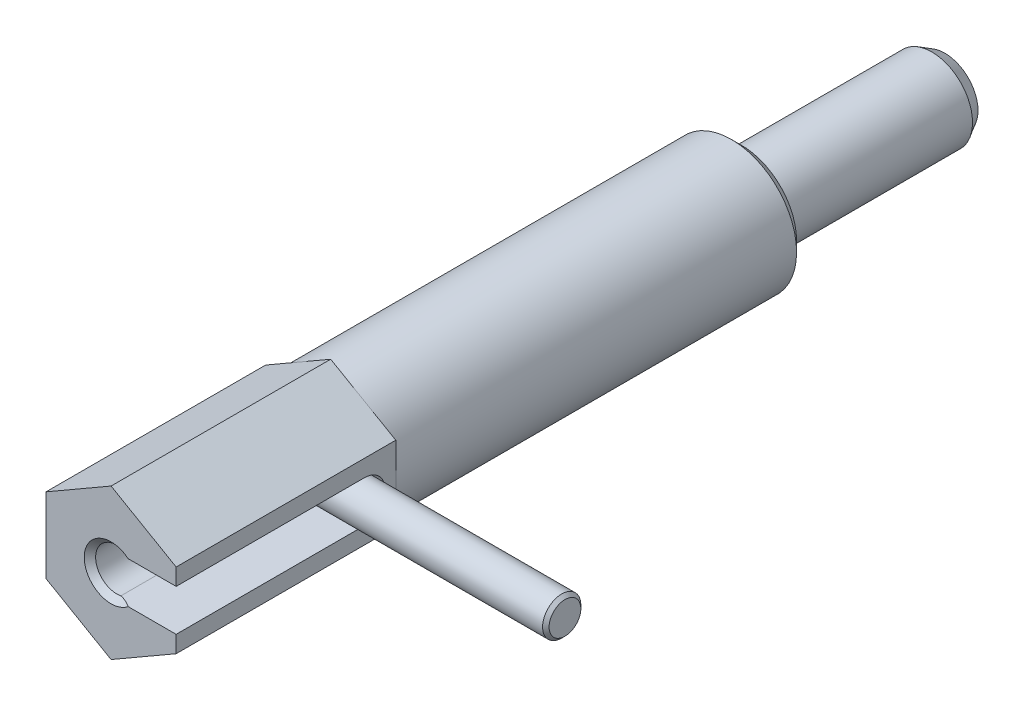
ISO-10303-21;
HEADER;
FILE_DESCRIPTION(('STEP AP214'),'2;1');
FILE_NAME('part.step','',(''),(''),'','','');
FILE_SCHEMA(('AUTOMOTIVE_DESIGN { 1 0 10303 214 1 1 1 1 }'));
ENDSEC;
DATA;
#1=APPLICATION_CONTEXT('core data for automotive mechanical design processes');
#2=APPLICATION_PROTOCOL_DEFINITION('international standard','automotive_design',2000,#1);
#3=PRODUCT_CONTEXT('',#1,'mechanical');
#4=PRODUCT('Part','Part','',(#3));
#5=PRODUCT_RELATED_PRODUCT_CATEGORY('part','',(#4));
#6=PRODUCT_DEFINITION_FORMATION('','',#4);
#7=PRODUCT_DEFINITION_CONTEXT('part definition',#1,'design');
#8=PRODUCT_DEFINITION('design','',#6,#7);
#9=PRODUCT_DEFINITION_SHAPE('','',#8);
#10=(LENGTH_UNIT() NAMED_UNIT(*) SI_UNIT(.MILLI.,.METRE.));
#11=(NAMED_UNIT(*) PLANE_ANGLE_UNIT() SI_UNIT($,.RADIAN.));
#12=(NAMED_UNIT(*) SI_UNIT($,.STERADIAN.) SOLID_ANGLE_UNIT());
#13=UNCERTAINTY_MEASURE_WITH_UNIT(LENGTH_MEASURE(1.E-05),#10,'distance_accuracy_value','');
#14=(GEOMETRIC_REPRESENTATION_CONTEXT(3) GLOBAL_UNCERTAINTY_ASSIGNED_CONTEXT((#13)) GLOBAL_UNIT_ASSIGNED_CONTEXT((#10,
#11,#12)) REPRESENTATION_CONTEXT('',''));
#15=CARTESIAN_POINT('',(0.,0.,0.));
#16=DIRECTION('',(0.,0.,1.));
#17=DIRECTION('',(1.,0.,0.));
#18=AXIS2_PLACEMENT_3D('',#15,#16,#17);
#19=CARTESIAN_POINT('',(1.70641111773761E-13,0.,48.8735285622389));
#20=DIRECTION('',(0.,0.,1.));
#21=DIRECTION('',(1.,0.,0.));
#22=AXIS2_PLACEMENT_3D('',#19,#20,#21);
#23=CYLINDRICAL_SURFACE('',#22,2.6);
#24=CARTESIAN_POINT('',(2.60000000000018,0.,51.8861902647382));
#25=CARTESIAN_POINT('',(2.59999836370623,-0.118590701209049,51.8861926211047));
#26=CARTESIAN_POINT('',(2.59185214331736,-0.237201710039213,51.8911356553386));
#27=CARTESIAN_POINT('',(2.55962961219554,-0.471484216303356,51.9105280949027));
#28=CARTESIAN_POINT('',(2.53554281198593,-0.587153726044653,51.9249837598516));
#29=CARTESIAN_POINT('',(2.47027992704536,-0.820611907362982,51.9639270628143));
#30=CARTESIAN_POINT('',(2.42804189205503,-0.937998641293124,51.9890366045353));
#31=CARTESIAN_POINT('',(2.32832586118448,-1.16365921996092,52.048771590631));
#32=CARTESIAN_POINT('',(2.27083550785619,-1.27192558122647,52.0834047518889));
#33=CARTESIAN_POINT('',(2.1733414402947,-1.428529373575,52.1441244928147));
#34=CARTESIAN_POINT('',(2.13779832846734,-1.48114058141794,52.1665908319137));
#35=CARTESIAN_POINT('',(2.0637124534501,-1.58273068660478,52.2146616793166));
#36=CARTESIAN_POINT('',(2.02516913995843,-1.63170891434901,52.2402667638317));
#37=CARTESIAN_POINT('',(1.94577367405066,-1.72561340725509,52.2949706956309));
#38=CARTESIAN_POINT('',(1.90492326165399,-1.77054266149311,52.3240669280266));
#39=CARTESIAN_POINT('',(1.82175713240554,-1.85600573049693,52.3862777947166));
#40=CARTESIAN_POINT('',(1.77944210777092,-1.89654158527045,52.4193905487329));
#41=CARTESIAN_POINT('',(1.68027464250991,-1.98555932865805,52.5020822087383));
#42=CARTESIAN_POINT('',(1.62325876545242,-2.03221287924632,52.5534785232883));
#43=CARTESIAN_POINT('',(1.51224978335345,-2.11611042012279,52.666168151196));
#44=CARTESIAN_POINT('',(1.45825009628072,-2.1533755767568,52.7274386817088));
#45=CARTESIAN_POINT('',(1.36719417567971,-2.21205351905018,52.8487884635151));
#46=CARTESIAN_POINT('',(1.32883982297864,-2.23511434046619,52.9070795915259));
#47=CARTESIAN_POINT('',(1.26034218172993,-2.27444622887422,53.030378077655));
#48=CARTESIAN_POINT('',(1.23019084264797,-2.29072396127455,53.0953787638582));
#49=CARTESIAN_POINT('',(1.1800397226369,-2.31696403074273,53.2303883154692));
#50=CARTESIAN_POINT('',(1.16004319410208,-2.32692434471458,53.3003987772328));
#51=CARTESIAN_POINT('',(1.13050716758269,-2.34141358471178,53.4431439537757));
#52=CARTESIAN_POINT('',(1.12098115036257,-2.34593550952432,53.5158820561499));
#53=CARTESIAN_POINT('',(1.10945209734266,-2.35142386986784,53.6916801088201));
#54=CARTESIAN_POINT('',(1.11205867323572,-2.35020848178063,53.7950889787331));
#55=CARTESIAN_POINT('',(1.13163580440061,-2.340829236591,54.0002464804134));
#56=CARTESIAN_POINT('',(1.14864850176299,-2.33264499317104,54.1019893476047));
#57=CARTESIAN_POINT('',(1.18929449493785,-2.31214164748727,54.2846559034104));
#58=CARTESIAN_POINT('',(1.21123176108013,-2.30080592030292,54.3660876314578));
#59=CARTESIAN_POINT('',(1.26068524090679,-2.27408493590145,54.5265939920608));
#60=CARTESIAN_POINT('',(1.288205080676,-2.25869704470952,54.6056670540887));
#61=CARTESIAN_POINT('',(1.34758589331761,-2.22378061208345,54.7613271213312));
#62=CARTESIAN_POINT('',(1.37945207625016,-2.20424708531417,54.8379110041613));
#63=CARTESIAN_POINT('',(1.44649240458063,-2.16084601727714,54.9883655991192));
#64=CARTESIAN_POINT('',(1.48166783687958,-2.13697678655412,55.0622352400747));
#65=CARTESIAN_POINT('',(1.59534633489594,-2.05522086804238,55.2884979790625));
#66=CARTESIAN_POINT('',(1.67815440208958,-1.98922990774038,55.4359353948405));
#67=CARTESIAN_POINT('',(1.84718142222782,-1.83333563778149,55.7151662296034));
#68=CARTESIAN_POINT('',(1.93339292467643,-1.74348233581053,55.8469915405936));
#69=CARTESIAN_POINT('',(2.07851861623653,-1.56497420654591,56.0576956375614));
#70=CARTESIAN_POINT('',(2.13846971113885,-1.48266464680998,56.1412136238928));
#71=CARTESIAN_POINT('',(2.25237869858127,-1.30309383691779,56.2953519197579));
#72=CARTESIAN_POINT('',(2.30634395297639,-1.2058513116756,56.3659881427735));
#73=CARTESIAN_POINT('',(2.3951130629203,-1.01602783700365,56.4797845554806));
#74=CARTESIAN_POINT('',(2.43161622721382,-0.925849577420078,56.5256072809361));
#75=CARTESIAN_POINT('',(2.49533855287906,-0.737014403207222,56.6046440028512));
#76=CARTESIAN_POINT('',(2.52256246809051,-0.638361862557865,56.6378644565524));
#77=CARTESIAN_POINT('',(2.56562834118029,-0.434165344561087,56.690070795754));
#78=CARTESIAN_POINT('',(2.58139218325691,-0.328579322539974,56.7089590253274));
#79=CARTESIAN_POINT('',(2.59968384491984,-0.114648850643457,56.7308542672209));
#80=CARTESIAN_POINT('',(2.60221875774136,-0.00630591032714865,56.7338697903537));
#81=CARTESIAN_POINT('',(2.59430382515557,0.196821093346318,56.724412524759));
#82=CARTESIAN_POINT('',(2.58529336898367,0.291749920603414,56.7136567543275));
#83=CARTESIAN_POINT('',(2.55742777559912,0.477937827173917,56.6801306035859));
#84=CARTESIAN_POINT('',(2.53857254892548,0.569196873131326,56.657360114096));
#85=CARTESIAN_POINT('',(2.49202028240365,0.747290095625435,56.600475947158));
#86=CARTESIAN_POINT('',(2.4641934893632,0.834036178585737,56.5661954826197));
#87=CARTESIAN_POINT('',(2.40155846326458,1.00020970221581,56.4878016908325));
#88=CARTESIAN_POINT('',(2.36674688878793,1.0796336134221,56.4436836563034));
#89=CARTESIAN_POINT('',(2.27490987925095,1.26482392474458,56.3249742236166));
#90=CARTESIAN_POINT('',(2.21498438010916,1.36613159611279,56.2456513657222));
#91=CARTESIAN_POINT('',(2.08930404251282,1.55159036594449,56.0728447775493));
#92=CARTESIAN_POINT('',(2.02353678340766,1.63570358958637,55.9793305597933));
#93=CARTESIAN_POINT('',(1.8673600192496,1.81424473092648,55.7463793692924));
#94=CARTESIAN_POINT('',(1.77633533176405,1.90208566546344,55.6022822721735));
#95=CARTESIAN_POINT('',(1.64464957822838,2.01456618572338,55.3741342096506));
#96=CARTESIAN_POINT('',(1.60150935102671,2.04887858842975,55.2959737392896));
#97=CARTESIAN_POINT('',(1.5179037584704,2.11156151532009,55.1359094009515));
#98=CARTESIAN_POINT('',(1.4774376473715,2.13993370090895,55.0540065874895));
#99=CARTESIAN_POINT('',(1.40713975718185,2.18664444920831,54.9014135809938));
#100=CARTESIAN_POINT('',(1.37668772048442,2.20587003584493,54.8312767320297));
#101=CARTESIAN_POINT('',(1.31918055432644,2.24073476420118,54.6887591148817));
#102=CARTESIAN_POINT('',(1.29212470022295,2.25637467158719,54.6163788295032));
#103=CARTESIAN_POINT('',(1.24238283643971,2.28413978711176,54.4696569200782));
#104=CARTESIAN_POINT('',(1.21968648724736,2.29627334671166,54.3953204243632));
#105=CARTESIAN_POINT('',(1.17974285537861,2.31704854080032,54.2447518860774));
#106=CARTESIAN_POINT('',(1.16249180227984,2.32569259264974,54.1685211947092));
#107=CARTESIAN_POINT('',(1.13306231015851,2.34018742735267,54.0044219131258));
#108=CARTESIAN_POINT('',(1.12183442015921,2.34552922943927,53.9163283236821));
#109=CARTESIAN_POINT('',(1.11078987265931,2.35078727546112,53.7392461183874));
#110=CARTESIAN_POINT('',(1.11095608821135,2.35071166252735,53.6502590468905));
#111=CARTESIAN_POINT('',(1.12423551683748,2.344383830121,53.4878511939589));
#112=CARTESIAN_POINT('',(1.13525622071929,2.33912978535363,53.4142346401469));
#113=CARTESIAN_POINT('',(1.16815830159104,2.32287424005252,53.2701493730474));
#114=CARTESIAN_POINT('',(1.1900252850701,2.3118803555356,53.199676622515));
#115=CARTESIAN_POINT('',(1.24408054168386,2.28323974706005,53.0640787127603));
#116=CARTESIAN_POINT('',(1.27628983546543,2.26557946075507,52.998964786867));
#117=CARTESIAN_POINT('',(1.34872427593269,2.22321780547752,52.8758544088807));
#118=CARTESIAN_POINT('',(1.38895967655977,2.19850741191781,52.8178672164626));
#119=CARTESIAN_POINT('',(1.48686938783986,2.13390716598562,52.6934989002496));
#120=CARTESIAN_POINT('',(1.54619586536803,2.09169073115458,52.6296500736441));
#121=CARTESIAN_POINT('',(1.66719748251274,1.99659782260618,52.5129924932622));
#122=CARTESIAN_POINT('',(1.7288779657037,1.94369576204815,52.4602108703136));
#123=CARTESIAN_POINT('',(1.8304077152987,1.84737493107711,52.3795721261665));
#124=CARTESIAN_POINT('',(1.87078201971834,1.80653674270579,52.3492181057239));
#125=CARTESIAN_POINT('',(1.94984374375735,1.72090124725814,52.2920551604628));
#126=CARTESIAN_POINT('',(1.98853065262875,1.67610275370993,52.2652473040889));
#127=CARTESIAN_POINT('',(2.06350840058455,1.58288167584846,52.2147602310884));
#128=CARTESIAN_POINT('',(2.09979890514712,1.53445858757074,52.1910814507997));
#129=CARTESIAN_POINT('',(2.16945113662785,1.43429604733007,52.1465389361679));
#130=CARTESIAN_POINT('',(2.20281177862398,1.38255537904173,52.1256762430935));
#131=CARTESIAN_POINT('',(2.26653714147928,1.27543648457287,52.0863341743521));
#132=CARTESIAN_POINT('',(2.29686006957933,1.22002140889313,52.0678871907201));
#133=CARTESIAN_POINT('',(2.3536646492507,1.10648237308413,52.0335780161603));
#134=CARTESIAN_POINT('',(2.38014481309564,1.04835737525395,52.0177168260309));
#135=CARTESIAN_POINT('',(2.45324955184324,0.870582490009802,51.9740166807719));
#136=CARTESIAN_POINT('',(2.49367190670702,0.747310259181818,51.9499808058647));
#137=CARTESIAN_POINT('',(2.54956229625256,0.520150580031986,51.9165869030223));
#138=CARTESIAN_POINT('',(2.56841689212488,0.417360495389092,51.9052474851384));
#139=CARTESIAN_POINT('',(2.59363425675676,0.209718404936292,51.8900494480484));
#140=CARTESIAN_POINT('',(2.60000144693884,0.104867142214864,51.8861881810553));
#141=CARTESIAN_POINT('',(2.60000000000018,0.,51.8861902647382));
#142=B_SPLINE_CURVE_WITH_KNOTS('',3,(#24,#25,#26,#27,#28,#29,#30,#31,#32,#33,#34,#35,#36,#37,
#38,#39,#40,#41,#42,#43,#44,#45,#46,#47,#48,#49,#50,#51,#52,#53,#54,#55,#56,#57,#58,#59,#60,#61,
#62,#63,#64,#65,#66,#67,#68,#69,#70,#71,#72,#73,#74,#75,#76,#77,#78,#79,#80,#81,#82,#83,#84,#85,
#86,#87,#88,#89,#90,#91,#92,#93,#94,#95,#96,#97,#98,#99,#100,#101,#102,#103,#104,#105,#106,#107,
#108,#109,#110,#111,#112,#113,#114,#115,#116,#117,#118,#119,#120,#121,#122,#123,#124,#125,#126,
#127,#128,#129,#130,#131,#132,#133,#134,#135,#136,#137,#138,#139,#140,#141),.UNSPECIFIED.,.T.,
.F.,(4,2,2,2,2,2,2,2,2,2,2,2,2,2,2,2,2,2,2,2,2,2,2,2,2,2,2,2,2,2,2,2,2,2,2,2,2,2,2,2,2,2,2,2,2,
2,2,2,2,2,2,2,2,2,2,2,2,2,4),(0.,0.355435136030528,0.711104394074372,1.09124940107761,
1.47170334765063,1.67355536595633,1.87544449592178,2.0771833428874,2.27882811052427,
2.54740190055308,2.81536465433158,3.0348713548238,3.25416184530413,3.47352252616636,
3.69316530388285,4.00176771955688,4.31127601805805,4.56621715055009,4.82132440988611,
5.07674020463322,5.33225573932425,5.87465198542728,6.41592039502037,6.80969675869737,
7.20298332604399,7.52430858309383,7.84546897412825,8.16879848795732,8.49195461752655,
8.7784774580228,9.06500290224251,9.35587362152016,9.6468838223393,10.0703152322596,
10.4946695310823,11.0666115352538,11.3533376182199,11.6399834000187,11.8763468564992,
12.1126597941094,12.3484051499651,12.5839869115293,12.8501836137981,13.1159801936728,
13.3389071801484,13.5615391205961,13.7846264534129,14.0080006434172,14.2969418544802,
14.5865833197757,14.7812259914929,14.9759271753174,15.1706554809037,15.3654555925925,
15.5626464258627,15.7599133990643,16.1536419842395,16.4680567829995,16.7823602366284),.UNSPECIFIED.);
#143=CARTESIAN_POINT('',(2.39626454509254,-1.00891834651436,52.0080811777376));
#144=VERTEX_POINT('',#143);
#145=CARTESIAN_POINT('',(1.1603198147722,-2.32672686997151,53.3065240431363));
#146=VERTEX_POINT('',#145);
#147=EDGE_CURVE('E161',#144,#146,#142,.T.);
#148=ORIENTED_EDGE('',*,*,#147,.F.);
#149=CARTESIAN_POINT('',(0.507444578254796,2.55,54.35));
#150=CARTESIAN_POINT('',(0.507261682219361,2.55001860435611,54.3125611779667));
#151=CARTESIAN_POINT('',(0.51160833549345,2.54917685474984,54.2755454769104));
#152=CARTESIAN_POINT('',(0.526976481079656,2.54605040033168,54.2038614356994));
#153=CARTESIAN_POINT('',(0.537834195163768,2.54380104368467,54.1691579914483));
#154=CARTESIAN_POINT('',(0.564790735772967,2.53795236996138,54.0998107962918));
#155=CARTESIAN_POINT('',(0.581153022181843,2.53428341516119,54.0652831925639));
#156=CARTESIAN_POINT('',(0.61694726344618,2.52581102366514,53.9979717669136));
#157=CARTESIAN_POINT('',(0.636384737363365,2.5210055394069,53.9651912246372));
#158=CARTESIAN_POINT('',(0.698250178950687,2.50484792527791,53.8676502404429));
#159=CARTESIAN_POINT('',(0.743586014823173,2.49188067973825,53.805041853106));
#160=CARTESIAN_POINT('',(0.858840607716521,2.4551151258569,53.6547665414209));
#161=CARTESIAN_POINT('',(0.930397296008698,2.42908354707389,53.5689667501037));
#162=CARTESIAN_POINT('',(1.07496348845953,2.36867929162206,53.4014461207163));
#163=CARTESIAN_POINT('',(1.14797490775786,2.33429484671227,53.3197312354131));
#164=CARTESIAN_POINT('',(1.29283824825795,2.25726605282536,53.1604559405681));
#165=CARTESIAN_POINT('',(1.36469475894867,2.21468560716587,53.0828689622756));
#166=CARTESIAN_POINT('',(1.50642356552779,2.12082815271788,52.9313684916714));
#167=CARTESIAN_POINT('',(1.57629743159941,2.06955826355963,52.8574520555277));
#168=CARTESIAN_POINT('',(1.74440157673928,1.93226690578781,52.6807207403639));
#169=CARTESIAN_POINT('',(1.84093687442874,1.8410924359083,52.5802028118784));
#170=CARTESIAN_POINT('',(2.02361480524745,1.63816615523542,52.3908885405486));
#171=CARTESIAN_POINT('',(2.10976288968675,1.52642521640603,52.3020860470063));
#172=CARTESIAN_POINT('',(2.24792814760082,1.31113012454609,52.1600498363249));
#173=CARTESIAN_POINT('',(2.3031902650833,1.21194674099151,52.1033793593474));
#174=CARTESIAN_POINT('',(2.40191037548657,1.00210567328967,52.0022793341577));
#175=CARTESIAN_POINT('',(2.44538470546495,0.891464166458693,51.95783284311));
#176=CARTESIAN_POINT('',(2.51209979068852,0.678147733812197,51.8896776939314));
#177=CARTESIAN_POINT('',(2.53740767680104,0.576803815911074,51.8638478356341));
#178=CARTESIAN_POINT('',(2.57576925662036,0.369463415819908,51.8247074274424));
#179=CARTESIAN_POINT('',(2.5888296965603,0.263469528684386,51.8113899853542));
#180=CARTESIAN_POINT('',(2.60174076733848,0.0495453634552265,51.7982247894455));
#181=CARTESIAN_POINT('',(2.60155613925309,-0.0583893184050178,51.7984129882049));
#182=CARTESIAN_POINT('',(2.5879039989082,-0.272523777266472,51.8123339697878));
#183=CARTESIAN_POINT('',(2.57443431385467,-0.378723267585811,51.8260689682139));
#184=CARTESIAN_POINT('',(2.5359850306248,-0.582333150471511,51.8652998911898));
#185=CARTESIAN_POINT('',(2.51146652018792,-0.679924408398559,51.8903247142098));
#186=CARTESIAN_POINT('',(2.4525646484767,-0.868750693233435,51.9504978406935));
#187=CARTESIAN_POINT('',(2.418177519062,-0.959983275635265,51.985650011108));
#188=CARTESIAN_POINT('',(2.32560199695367,-1.17028313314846,52.0804037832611));
#189=CARTESIAN_POINT('',(2.26340854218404,-1.2857267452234,52.1441474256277));
#190=CARTESIAN_POINT('',(2.12701030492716,-1.50070873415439,52.2843449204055));
#191=CARTESIAN_POINT('',(2.05277955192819,-1.6002117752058,52.3608262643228));
#192=CARTESIAN_POINT('',(1.86644538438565,-1.81763641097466,52.5536216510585));
#193=CARTESIAN_POINT('',(1.75054337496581,-1.92858354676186,52.6741522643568));
#194=CARTESIAN_POINT('',(1.56998919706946,-2.07391480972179,52.8641498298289));
#195=CARTESIAN_POINT('',(1.50862360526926,-2.11887764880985,52.9290847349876));
#196=CARTESIAN_POINT('',(1.38438985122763,-2.20205664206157,53.0617591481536));
#197=CARTESIAN_POINT('',(1.32152219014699,-2.2402750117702,53.129497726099));
#198=CARTESIAN_POINT('',(1.17125901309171,-2.32335918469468,53.2936363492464));
#199=CARTESIAN_POINT('',(1.08353591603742,-2.3653145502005,53.3912297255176));
#200=CARTESIAN_POINT('',(0.953703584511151,-2.41922623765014,53.542116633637));
#201=CARTESIAN_POINT('',(0.910747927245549,-2.43568478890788,53.5931241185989));
#202=CARTESIAN_POINT('',(0.826284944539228,-2.46561267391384,53.6971655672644));
#203=CARTESIAN_POINT('',(0.784776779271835,-2.47908376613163,53.7501983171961));
#204=CARTESIAN_POINT('',(0.714020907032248,-2.50024279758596,53.8468651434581));
#205=CARTESIAN_POINT('',(0.684132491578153,-2.50854917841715,53.8898921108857));
#206=CARTESIAN_POINT('',(0.627870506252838,-2.52321474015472,53.978632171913));
#207=CARTESIAN_POINT('',(0.601497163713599,-2.52957379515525,54.0243454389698));
#208=CARTESIAN_POINT('',(0.563261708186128,-2.53830454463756,54.1039408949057));
#209=CARTESIAN_POINT('',(0.549474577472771,-2.54130013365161,54.1368032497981));
#210=CARTESIAN_POINT('',(0.527020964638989,-2.54605254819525,54.2042499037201));
#211=CARTESIAN_POINT('',(0.518325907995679,-2.54781629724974,54.2388233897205));
#212=CARTESIAN_POINT('',(0.511251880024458,-2.54924001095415,54.2864788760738));
#213=CARTESIAN_POINT('',(0.509833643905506,-2.54952367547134,54.299111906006));
#214=CARTESIAN_POINT('',(0.507926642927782,-2.54990413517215,54.3244943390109));
#215=CARTESIAN_POINT('',(0.507441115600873,-2.55000027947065,54.337243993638));
#216=CARTESIAN_POINT('',(0.507444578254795,-2.55,54.35));
#217=B_SPLINE_CURVE_WITH_KNOTS('',3,(#149,#150,#151,#152,#153,#154,#155,#156,#157,#158,#159,
#160,#161,#162,#163,#164,#165,#166,#167,#168,#169,#170,#171,#172,#173,#174,#175,#176,#177,#178,
#179,#180,#181,#182,#183,#184,#185,#186,#187,#188,#189,#190,#191,#192,#193,#194,#195,#196,#197,
#198,#199,#200,#201,#202,#203,#204,#205,#206,#207,#208,#209,#210,#211,#212,#213,#214,#215,#216),
.UNSPECIFIED.,.F.,.F.,(4,2,2,2,2,2,2,2,2,2,2,2,2,2,2,2,2,2,2,2,2,2,2,2,2,2,2,2,2,2,2,2,2,4),(0.,
0.111402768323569,0.220114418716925,0.33502244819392,0.45013909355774,0.684836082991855,
1.02853863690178,1.37272826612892,1.71433569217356,2.05566456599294,2.55356299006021,
3.05119896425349,3.43051075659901,3.8092941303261,4.13071445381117,4.45195762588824,
4.77405599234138,5.09620704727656,5.40600688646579,5.71592517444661,6.15090347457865,
6.58683304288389,7.18537075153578,7.4852332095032,7.78499697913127,8.19756295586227,
8.40355504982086,8.60942556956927,8.76845312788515,8.92749096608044,9.03451883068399,
9.14094019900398,9.17905504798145,9.21730196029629),.UNSPECIFIED.);
#218=CARTESIAN_POINT('',(2.39626454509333,1.0089183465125,52.0080811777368));
#219=VERTEX_POINT('',#218);
#220=EDGE_CURVE('E153',#219,#144,#217,.T.);
#221=ORIENTED_EDGE('',*,*,#220,.F.);
#222=CARTESIAN_POINT('',(1.160319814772,2.32672686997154,53.3065240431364));
#223=VERTEX_POINT('',#222);
#224=EDGE_CURVE('E157',#223,#219,#142,.T.);
#225=ORIENTED_EDGE('',*,*,#224,.F.);
#226=CARTESIAN_POINT('',(0.507444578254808,2.55,54.35));
#227=VERTEX_POINT('',#226);
#228=EDGE_CURVE('E145',#227,#223,#217,.T.);
#229=ORIENTED_EDGE('',*,*,#228,.F.);
#230=DIRECTION('',(0.,0.,-1.));
#231=VECTOR('',#230,1.);
#232=CARTESIAN_POINT('',(0.50744457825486,2.55,65.925));
#233=LINE('',#232,#231);
#234=CARTESIAN_POINT('',(0.507444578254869,2.55,76.8));
#235=VERTEX_POINT('',#234);
#236=EDGE_CURVE('E242',#235,#227,#233,.T.);
#237=ORIENTED_EDGE('',*,*,#236,.F.);
#238=CARTESIAN_POINT('',(2.68145922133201E-13,0.,76.8));
#239=DIRECTION('',(0.,0.,-1.));
#240=DIRECTION('',(0.,1.,0.));
#241=AXIS2_PLACEMENT_3D('',#238,#239,#240);
#242=CIRCLE('',#241,2.6);
#243=CARTESIAN_POINT('',(0.507444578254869,-2.55,76.8));
#244=VERTEX_POINT('',#243);
#245=EDGE_CURVE('E486',#244,#235,#242,.T.);
#246=ORIENTED_EDGE('',*,*,#245,.F.);
#247=DIRECTION('',(0.,0.,1.));
#248=VECTOR('',#247,1.);
#249=CARTESIAN_POINT('',(0.50744457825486,-2.55,65.925));
#250=LINE('',#249,#248);
#251=CARTESIAN_POINT('',(0.50744457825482,-2.55,54.35));
#252=VERTEX_POINT('',#251);
#253=EDGE_CURVE('E243',#252,#244,#250,.T.);
#254=ORIENTED_EDGE('',*,*,#253,.F.);
#255=EDGE_CURVE('E155',#146,#252,#217,.T.);
#256=ORIENTED_EDGE('',*,*,#255,.F.);
#257=EDGE_LOOP('',(#148,#221,#225,#229,#237,#246,#254,#256));
#258=FACE_BOUND('',#257,.T.);
#259=CARTESIAN_POINT('',(1.7414954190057E-13,0.,50.5));
#260=DIRECTION('',(0.,0.,-1.));
#261=DIRECTION('',(-1.,0.,0.));
#262=AXIS2_PLACEMENT_3D('',#259,#260,#261);
#263=CIRCLE('',#262,2.6);
#264=CARTESIAN_POINT('',(-2.59999999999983,0.,50.5));
#265=VERTEX_POINT('',#264);
#266=EDGE_CURVE('E275',#265,#265,#263,.T.);
#267=ORIENTED_EDGE('',*,*,#266,.T.);
#268=EDGE_LOOP('',(#267));
#269=FACE_BOUND('',#268,.T.);
#270=ADVANCED_FACE('F14',(#258,#269),#23,.F.);
#271=CARTESIAN_POINT('',(2.70589960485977E-13,0.,77.5));
#272=DIRECTION('',(0.,0.,1.));
#273=DIRECTION('',(1.,0.,0.));
#274=AXIS2_PLACEMENT_3D('',#271,#272,#273);
#275=CONICAL_SURFACE('',#274,3.3,0.785398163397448);
#276=CARTESIAN_POINT('',(2.09463600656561,2.55,77.5));
#277=CARTESIAN_POINT('',(2.03313194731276,2.55,77.4609724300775));
#278=CARTESIAN_POINT('',(1.97116701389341,2.55,77.4226568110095));
#279=CARTESIAN_POINT('',(1.84617516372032,2.55,77.3477514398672));
#280=CARTESIAN_POINT('',(1.78314788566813,2.55,77.3111622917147));
#281=CARTESIAN_POINT('',(1.65646998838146,2.55,77.2403392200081));
#282=CARTESIAN_POINT('',(1.59282910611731,2.55,77.2060880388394));
#283=CARTESIAN_POINT('',(1.46431098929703,2.55,77.1400119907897));
#284=CARTESIAN_POINT('',(1.39943373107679,2.55,77.1081871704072));
#285=CARTESIAN_POINT('',(1.20229735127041,2.55,77.0168069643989));
#286=CARTESIAN_POINT('',(1.06792232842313,2.55,76.9615694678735));
#287=CARTESIAN_POINT('',(0.792468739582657,2.55,76.8671555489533));
#288=CARTESIAN_POINT('',(0.651343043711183,2.55,76.8281190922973));
#289=CARTESIAN_POINT('',(0.507444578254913,2.55,76.8));
#290=B_SPLINE_CURVE_WITH_KNOTS('',3,(#276,#277,#278,#279,#280,#281,#282,#283,#284,#285,#286,
#287,#288,#289),.UNSPECIFIED.,.F.,.F.,(4,2,2,2,2,2,4),(0.,0.218530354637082,0.437136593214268,
0.653899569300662,0.870666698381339,1.30554319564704,1.74410221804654),.UNSPECIFIED.);
#291=CARTESIAN_POINT('',(2.09463600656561,2.55,77.5));
#292=VERTEX_POINT('',#291);
#293=EDGE_CURVE('E212',#292,#235,#290,.T.);
#294=ORIENTED_EDGE('',*,*,#293,.F.);
#295=CARTESIAN_POINT('',(2.70589960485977E-13,0.,77.5));
#296=DIRECTION('',(0.,0.,1.));
#297=DIRECTION('',(1.,0.,0.));
#298=AXIS2_PLACEMENT_3D('',#295,#296,#297);
#299=CIRCLE('',#298,3.3);
#300=CARTESIAN_POINT('',(2.09463600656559,-2.55,77.5));
#301=VERTEX_POINT('',#300);
#302=EDGE_CURVE('E203',#301,#292,#299,.F.);
#303=ORIENTED_EDGE('',*,*,#302,.F.);
#304=CARTESIAN_POINT('',(0.507444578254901,-2.55,76.8));
#305=CARTESIAN_POINT('',(0.604817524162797,-2.55,76.8189846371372));
#306=CARTESIAN_POINT('',(0.701039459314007,-2.55,76.84305031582));
#307=CARTESIAN_POINT('',(0.890732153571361,-2.55,76.899583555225));
#308=CARTESIAN_POINT('',(0.984209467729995,-2.55,76.9320289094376));
#309=CARTESIAN_POINT('',(1.16760170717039,-2.55,77.0033383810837));
#310=CARTESIAN_POINT('',(1.25754203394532,-2.55,77.0421386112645));
#311=CARTESIAN_POINT('',(1.43501170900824,-2.55,77.1249963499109));
#312=CARTESIAN_POINT('',(1.52253960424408,-2.55,77.169056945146));
#313=CARTESIAN_POINT('',(1.69157857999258,-2.55,77.259255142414));
#314=CARTESIAN_POINT('',(1.77318495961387,-2.55,77.3052161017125));
#315=CARTESIAN_POINT('',(1.93500161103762,-2.55,77.4003883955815));
#316=CARTESIAN_POINT('',(2.01520353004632,-2.55,77.4496139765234));
#317=CARTESIAN_POINT('',(2.09463600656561,-2.55,77.5));
#318=B_SPLINE_CURVE_WITH_KNOTS('',3,(#304,#305,#306,#307,#308,#309,#310,#311,#312,#313,#314,
#315,#316,#317),.UNSPECIFIED.,.F.,.F.,(4,2,2,2,2,2,4),(0.,0.29725682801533,0.593733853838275,
0.887395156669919,1.18122963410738,1.46213770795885,1.74436454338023),.UNSPECIFIED.);
#319=EDGE_CURVE('E236',#244,#301,#318,.T.);
#320=ORIENTED_EDGE('',*,*,#319,.F.);
#321=ORIENTED_EDGE('',*,*,#245,.T.);
#322=EDGE_LOOP('',(#294,#303,#320,#321));
#323=FACE_BOUND('',#322,.T.);
#324=ADVANCED_FACE('F233',(#323),#275,.F.);
#325=CARTESIAN_POINT('',(0.50744457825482,-2.55,54.35));
#326=DIRECTION('',(0.,1.,0.));
#327=DIRECTION('',(0.,0.,1.));
#328=AXIS2_PLACEMENT_3D('',#325,#326,#327);
#329=PLANE('',#328);
#330=DIRECTION('',(0.,0.,1.));
#331=VECTOR('',#330,1.);
#332=CARTESIAN_POINT('',(8.00000000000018,-2.55,50.5));
#333=LINE('',#332,#331);
#334=CARTESIAN_POINT('',(8.00000000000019,-2.55,54.35));
#335=VERTEX_POINT('',#334);
#336=CARTESIAN_POINT('',(8.00000000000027,-2.55,77.5));
#337=VERTEX_POINT('',#336);
#338=EDGE_CURVE('E473',#335,#337,#333,.T.);
#339=ORIENTED_EDGE('',*,*,#338,.F.);
#340=DIRECTION('',(1.,0.,0.));
#341=VECTOR('',#340,1.);
#342=CARTESIAN_POINT('',(4.25349705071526,-2.55,54.35));
#343=LINE('',#342,#341);
#344=EDGE_CURVE('E152',#252,#335,#343,.T.);
#345=ORIENTED_EDGE('',*,*,#344,.F.);
#346=ORIENTED_EDGE('',*,*,#253,.T.);
#347=ORIENTED_EDGE('',*,*,#319,.T.);
#348=DIRECTION('',(-1.,0.,0.));
#349=VECTOR('',#348,1.);
#350=CARTESIAN_POINT('',(2.70589960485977E-13,-2.55,77.5));
#351=LINE('',#350,#349);
#352=EDGE_CURVE('E206',#337,#301,#351,.T.);
#353=ORIENTED_EDGE('',*,*,#352,.F.);
#354=EDGE_LOOP('',(#339,#345,#346,#347,#353));
#355=FACE_BOUND('',#354,.T.);
#356=ADVANCED_FACE('F229',(#355),#329,.T.);
#357=CARTESIAN_POINT('',(0.507444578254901,2.55,77.5));
#358=DIRECTION('',(0.,-1.,0.));
#359=DIRECTION('',(0.,0.,-1.));
#360=AXIS2_PLACEMENT_3D('',#357,#358,#359);
#361=PLANE('',#360);
#362=DIRECTION('',(1.,0.,0.));
#363=VECTOR('',#362,1.);
#364=CARTESIAN_POINT('',(2.70589960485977E-13,2.55,77.5));
#365=LINE('',#364,#363);
#366=CARTESIAN_POINT('',(8.00000000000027,2.55,77.5));
#367=VERTEX_POINT('',#366);
#368=EDGE_CURVE('E205',#292,#367,#365,.T.);
#369=ORIENTED_EDGE('',*,*,#368,.F.);
#370=ORIENTED_EDGE('',*,*,#293,.T.);
#371=ORIENTED_EDGE('',*,*,#236,.T.);
#372=DIRECTION('',(-1.,0.,0.));
#373=VECTOR('',#372,1.);
#374=CARTESIAN_POINT('',(4.25349705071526,2.55,54.35));
#375=LINE('',#374,#373);
#376=CARTESIAN_POINT('',(8.00000000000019,2.55,54.35));
#377=VERTEX_POINT('',#376);
#378=EDGE_CURVE('E149',#377,#227,#375,.T.);
#379=ORIENTED_EDGE('',*,*,#378,.F.);
#380=DIRECTION('',(0.,0.,1.));
#381=VECTOR('',#380,1.);
#382=CARTESIAN_POINT('',(8.00000000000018,2.55,50.5));
#383=LINE('',#382,#381);
#384=EDGE_CURVE('E202',#367,#377,#383,.F.);
#385=ORIENTED_EDGE('',*,*,#384,.F.);
#386=EDGE_LOOP('',(#369,#370,#371,#379,#385));
#387=FACE_BOUND('',#386,.T.);
#388=ADVANCED_FACE('F223',(#387),#361,.T.);
#389=CARTESIAN_POINT('',(0.50699410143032,0.,54.35));
#390=DIRECTION('',(1.,0.,0.));
#391=DIRECTION('',(0.,0.,-1.));
#392=AXIS2_PLACEMENT_3D('',#389,#390,#391);
#393=CYLINDRICAL_SURFACE('',#392,2.55);
#394=CARTESIAN_POINT('',(0.462489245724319,-2.34035452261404,53.3374582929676));
#395=CARTESIAN_POINT('',(0.501032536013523,-2.34281326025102,53.3431426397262));
#396=CARTESIAN_POINT('',(0.539733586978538,-2.34483779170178,53.3478758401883));
#397=CARTESIAN_POINT('',(0.617433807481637,-2.34793771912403,53.3551619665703));
#398=CARTESIAN_POINT('',(0.656433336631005,-2.34901168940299,53.3577116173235));
#399=CARTESIAN_POINT('',(0.774537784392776,-2.35068921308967,53.3616738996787));
#400=CARTESIAN_POINT('',(0.8538972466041,-2.34969033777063,53.3592616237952));
#401=CARTESIAN_POINT('',(0.972100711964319,-2.34415723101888,53.3462871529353));
#402=CARTESIAN_POINT('',(1.01157853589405,-2.34161492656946,53.3403436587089));
#403=CARTESIAN_POINT('',(1.08973739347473,-2.33497955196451,53.3250890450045));
#404=CARTESIAN_POINT('',(1.12841892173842,-2.33088747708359,53.3157800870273));
#405=CARTESIAN_POINT('',(1.20433790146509,-2.32100554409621,53.2937914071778));
#406=CARTESIAN_POINT('',(1.2415825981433,-2.3152259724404,53.2811321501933));
#407=CARTESIAN_POINT('',(1.31444184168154,-2.30180911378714,53.2525375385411));
#408=CARTESIAN_POINT('',(1.3500566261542,-2.294172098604,53.2366026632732));
#409=CARTESIAN_POINT('',(1.41444852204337,-2.27814431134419,53.2042093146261));
#410=CARTESIAN_POINT('',(1.44348470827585,-2.27000888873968,53.1881367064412));
#411=CARTESIAN_POINT('',(1.49994683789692,-2.25225662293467,53.1540858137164));
#412=CARTESIAN_POINT('',(1.5273721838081,-2.24263923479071,53.1361068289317));
#413=CARTESIAN_POINT('',(1.60722436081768,-2.21149523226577,53.0797163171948));
#414=CARTESIAN_POINT('',(1.65711527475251,-2.187704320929,53.0389095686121));
#415=CARTESIAN_POINT('',(1.73726019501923,-2.14180008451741,52.9656166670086));
#416=CARTESIAN_POINT('',(1.76911958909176,-2.12105605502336,52.9339673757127));
#417=CARTESIAN_POINT('',(1.82971873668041,-2.07669557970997,52.8696760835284));
#418=CARTESIAN_POINT('',(1.85845713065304,-2.05307789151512,52.8370336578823));
#419=CARTESIAN_POINT('',(1.91317629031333,-2.00309330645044,52.7714496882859));
#420=CARTESIAN_POINT('',(1.9391527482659,-1.97672223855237,52.7385077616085));
#421=CARTESIAN_POINT('',(1.98865148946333,-1.92140532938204,52.6729361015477));
#422=CARTESIAN_POINT('',(2.01217311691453,-1.89245880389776,52.6403064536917));
#423=CARTESIAN_POINT('',(2.0648246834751,-1.82170704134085,52.5646680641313));
#424=CARTESIAN_POINT('',(2.09308221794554,-1.77891601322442,52.5219709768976));
#425=CARTESIAN_POINT('',(2.14629176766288,-1.68927631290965,52.4388256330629));
#426=CARTESIAN_POINT('',(2.17124281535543,-1.64242645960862,52.3983780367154));
#427=CARTESIAN_POINT('',(2.21825550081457,-1.54501328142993,52.3203874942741));
#428=CARTESIAN_POINT('',(2.24031729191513,-1.49445015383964,52.2828443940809));
#429=CARTESIAN_POINT('',(2.28183731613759,-1.38992530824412,52.2111624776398));
#430=CARTESIAN_POINT('',(2.30129459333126,-1.33596235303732,52.1770249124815));
#431=CARTESIAN_POINT('',(2.33789101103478,-1.22455947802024,52.1123370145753));
#432=CARTESIAN_POINT('',(2.35501071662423,-1.16709555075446,52.081817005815));
#433=CARTESIAN_POINT('',(2.3868004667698,-1.04941729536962,52.0250282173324));
#434=CARTESIAN_POINT('',(2.40146939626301,-0.989201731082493,51.9987613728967));
#435=CARTESIAN_POINT('',(2.42829052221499,-0.866467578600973,51.9508184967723));
#436=CARTESIAN_POINT('',(2.44044419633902,-0.80395036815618,51.9291397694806));
#437=CARTESIAN_POINT('',(2.46212455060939,-0.67700139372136,51.8906161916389));
#438=CARTESIAN_POINT('',(2.4716514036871,-0.612569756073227,51.8737710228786));
#439=CARTESIAN_POINT('',(2.48786571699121,-0.482675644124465,51.8452212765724));
#440=CARTESIAN_POINT('',(2.49457147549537,-0.417222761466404,51.8334835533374));
#441=CARTESIAN_POINT('',(2.50507808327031,-0.285397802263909,51.8151478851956));
#442=CARTESIAN_POINT('',(2.50888017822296,-0.219026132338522,51.808547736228));
#443=CARTESIAN_POINT('',(2.51347657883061,-0.085869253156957,51.8005742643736));
#444=CARTESIAN_POINT('',(2.51427128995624,-0.019084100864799,51.7992002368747));
#445=CARTESIAN_POINT('',(2.51283461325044,0.114335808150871,51.8016893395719));
#446=CARTESIAN_POINT('',(2.51060334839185,0.180970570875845,51.8055522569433));
#447=CARTESIAN_POINT('',(2.49991170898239,0.371612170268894,51.8241414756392));
#448=CARTESIAN_POINT('',(2.48771107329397,0.494850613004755,51.8454123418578));
#449=CARTESIAN_POINT('',(2.45385389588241,0.73558960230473,51.9052425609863));
#450=CARTESIAN_POINT('',(2.4321958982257,0.853089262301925,51.9438045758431));
#451=CARTESIAN_POINT('',(2.37954033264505,1.08305793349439,52.0380024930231));
#452=CARTESIAN_POINT('',(2.34828825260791,1.19527947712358,52.0941045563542));
#453=CARTESIAN_POINT('',(2.29453855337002,1.35495211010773,52.1888733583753));
#454=CARTESIAN_POINT('',(2.27544986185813,1.40678963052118,52.2222784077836));
#455=CARTESIAN_POINT('',(2.23480700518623,1.5072673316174,52.2922381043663));
#456=CARTESIAN_POINT('',(2.21325368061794,1.5559085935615,52.3287916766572));
#457=CARTESIAN_POINT('',(2.16599823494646,1.65261207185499,52.4069417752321));
#458=CARTESIAN_POINT('',(2.14012140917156,1.70044992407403,52.4487105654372));
#459=CARTESIAN_POINT('',(2.08481250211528,1.7918338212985,52.5345766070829));
#460=CARTESIAN_POINT('',(2.05537915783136,1.83537833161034,52.5786746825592));
#461=CARTESIAN_POINT('',(1.99237784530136,1.91767840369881,52.668128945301));
#462=CARTESIAN_POINT('',(1.9588205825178,1.95644586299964,52.7134816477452));
#463=CARTESIAN_POINT('',(1.88671921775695,2.02889170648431,52.8042103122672));
#464=CARTESIAN_POINT('',(1.84818013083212,2.06257513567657,52.849586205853));
#465=CARTESIAN_POINT('',(1.76157941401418,2.12713138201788,52.9424286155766));
#466=CARTESIAN_POINT('',(1.71298856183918,2.15752691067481,52.9897482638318));
#467=CARTESIAN_POINT('',(1.63423869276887,2.19793096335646,53.0568294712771));
#468=CARTESIAN_POINT('',(1.60702895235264,2.21052830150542,53.0785287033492));
#469=CARTESIAN_POINT('',(1.55062217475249,2.23398176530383,53.1202055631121));
#470=CARTESIAN_POINT('',(1.52142615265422,2.24483877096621,53.1401840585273));
#471=CARTESIAN_POINT('',(1.46079094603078,2.26491355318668,53.1781916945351));
#472=CARTESIAN_POINT('',(1.42933154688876,2.27411305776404,53.1961983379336));
#473=CARTESIAN_POINT('',(1.36462733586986,2.29076803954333,53.2296291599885));
#474=CARTESIAN_POINT('',(1.3313825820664,2.29822357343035,53.2450534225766));
#475=CARTESIAN_POINT('',(1.26338085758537,2.31147250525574,53.2730432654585));
#476=CARTESIAN_POINT('',(1.2286234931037,2.31726546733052,53.2856080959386));
#477=CARTESIAN_POINT('',(1.15796200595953,2.32730477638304,53.3077435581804));
#478=CARTESIAN_POINT('',(1.12205789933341,2.33155114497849,53.3173142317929));
#479=CARTESIAN_POINT('',(1.02159444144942,2.34136136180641,53.339662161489));
#480=CARTESIAN_POINT('',(0.9561683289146,2.34543962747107,53.3492729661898));
#481=CARTESIAN_POINT('',(0.824506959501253,2.35001455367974,53.3600713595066));
#482=CARTESIAN_POINT('',(0.75827075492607,2.35050651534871,53.3612478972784));
#483=CARTESIAN_POINT('',(0.653647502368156,2.34894199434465,53.3575431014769));
#484=CARTESIAN_POINT('',(0.615134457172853,2.34786026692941,53.3549776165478));
#485=CARTESIAN_POINT('',(0.53852155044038,2.34477461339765,53.3477297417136));
#486=CARTESIAN_POINT('',(0.500420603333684,2.34277495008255,53.3430571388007));
#487=CARTESIAN_POINT('',(0.462489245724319,2.34035452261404,53.3374582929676));
#488=B_SPLINE_CURVE_WITH_KNOTS('',3,(#394,#395,#396,#397,#398,#399,#400,#401,#402,#403,#404,
#405,#406,#407,#408,#409,#410,#411,#412,#413,#414,#415,#416,#417,#418,#419,#420,#421,#422,#423,
#424,#425,#426,#427,#428,#429,#430,#431,#432,#433,#434,#435,#436,#437,#438,#439,#440,#441,#442,
#443,#444,#445,#446,#447,#448,#449,#450,#451,#452,#453,#454,#455,#456,#457,#458,#459,#460,#461,
#462,#463,#464,#465,#466,#467,#468,#469,#470,#471,#472,#473,#474,#475,#476,#477,#478,#479,#480,
#481,#482,#483,#484,#485,#486,#487),.UNSPECIFIED.,.F.,.F.,(4,2,2,2,2,2,2,2,2,2,2,2,2,2,2,2,2,2,
2,2,2,2,2,2,2,2,2,2,2,2,2,2,2,2,2,2,2,2,2,2,2,2,2,2,2,2,4),(0.,0.117069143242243,
0.234313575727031,0.471378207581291,0.591243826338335,0.711032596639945,0.830105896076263,
0.949161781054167,1.05154416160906,1.15396428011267,1.35918769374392,1.50741219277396,
1.65570100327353,1.80421780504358,1.95277418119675,2.1526887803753,2.3526617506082,
2.55262410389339,2.7526596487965,2.9542684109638,3.15596865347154,3.35755006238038,
3.55911819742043,3.75935796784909,3.9595117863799,4.15963861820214,4.3597573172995,
4.73481662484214,5.10993369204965,5.49601640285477,5.68951950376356,5.8829568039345,
6.08843063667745,6.29397765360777,6.49900192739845,6.70382139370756,6.92593084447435,
7.03685694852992,7.14772678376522,7.25975261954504,7.37177481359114,7.48382634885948,
7.59587631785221,7.79382542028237,7.99203383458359,8.10781170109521,8.22305726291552),.UNSPECIFIED.);
#489=EDGE_CURVE('E9',#146,#144,#488,.T.);
#490=ORIENTED_EDGE('',*,*,#489,.F.);
#491=ORIENTED_EDGE('',*,*,#255,.T.);
#492=ORIENTED_EDGE('',*,*,#344,.T.);
#493=CARTESIAN_POINT('',(8.00000000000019,0.,54.35));
#494=DIRECTION('',(1.,0.,0.));
#495=DIRECTION('',(0.,0.,-1.));
#496=AXIS2_PLACEMENT_3D('',#493,#494,#495);
#497=CIRCLE('',#496,2.55);
#498=EDGE_CURVE('E198',#377,#335,#497,.F.);
#499=ORIENTED_EDGE('',*,*,#498,.F.);
#500=ORIENTED_EDGE('',*,*,#378,.T.);
#501=ORIENTED_EDGE('',*,*,#228,.T.);
#502=EDGE_CURVE('E18',#219,#223,#488,.T.);
#503=ORIENTED_EDGE('',*,*,#502,.F.);
#504=ORIENTED_EDGE('',*,*,#220,.T.);
#505=EDGE_LOOP('',(#490,#491,#492,#499,#500,#501,#503,#504));
#506=FACE_BOUND('',#505,.T.);
#507=ADVANCED_FACE('F147',(#506),#393,.F.);
#508=CARTESIAN_POINT('',(-7.99999999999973,-9.34845555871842,77.5));
#509=DIRECTION('',(0.,0.,1.));
#510=DIRECTION('',(1.,0.,0.));
#511=AXIS2_PLACEMENT_3D('',#508,#509,#510);
#512=PLANE('',#511);
#513=DIRECTION('',(-0.866025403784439,-0.5,0.));
#514=VECTOR('',#513,1.);
#515=CARTESIAN_POINT('',(4.00000000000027,-6.92820323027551,77.5));
#516=LINE('',#515,#514);
#517=CARTESIAN_POINT('',(8.00000000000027,-4.61880215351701,77.5));
#518=VERTEX_POINT('',#517);
#519=CARTESIAN_POINT('',(2.70589960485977E-13,-9.23760430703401,77.5));
#520=VERTEX_POINT('',#519);
#521=EDGE_CURVE('E443',#518,#520,#516,.T.);
#522=ORIENTED_EDGE('',*,*,#521,.F.);
#523=DIRECTION('',(0.,-1.,0.));
#524=VECTOR('',#523,1.);
#525=CARTESIAN_POINT('',(8.00000000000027,0.,77.5));
#526=LINE('',#525,#524);
#527=EDGE_CURVE('E461',#337,#518,#526,.T.);
#528=ORIENTED_EDGE('',*,*,#527,.F.);
#529=ORIENTED_EDGE('',*,*,#352,.T.);
#530=ORIENTED_EDGE('',*,*,#302,.T.);
#531=ORIENTED_EDGE('',*,*,#368,.T.);
#532=DIRECTION('',(0.,-1.,0.));
#533=VECTOR('',#532,1.);
#534=CARTESIAN_POINT('',(8.00000000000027,0.,77.5));
#535=LINE('',#534,#533);
#536=CARTESIAN_POINT('',(8.00000000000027,4.61880215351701,77.5));
#537=VERTEX_POINT('',#536);
#538=EDGE_CURVE('E458',#537,#367,#535,.T.);
#539=ORIENTED_EDGE('',*,*,#538,.F.);
#540=DIRECTION('',(0.866025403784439,-0.5,0.));
#541=VECTOR('',#540,1.);
#542=CARTESIAN_POINT('',(4.00000000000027,6.92820323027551,77.5));
#543=LINE('',#542,#541);
#544=CARTESIAN_POINT('',(2.70589960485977E-13,9.23760430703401,77.5));
#545=VERTEX_POINT('',#544);
#546=EDGE_CURVE('E419',#545,#537,#543,.T.);
#547=ORIENTED_EDGE('',*,*,#546,.F.);
#548=DIRECTION('',(0.866025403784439,0.5,0.));
#549=VECTOR('',#548,1.);
#550=CARTESIAN_POINT('',(-3.99999999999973,6.92820323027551,77.5));
#551=LINE('',#550,#549);
#552=CARTESIAN_POINT('',(-7.99999999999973,4.61880215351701,77.5));
#553=VERTEX_POINT('',#552);
#554=EDGE_CURVE('E416',#553,#545,#551,.T.);
#555=ORIENTED_EDGE('',*,*,#554,.F.);
#556=DIRECTION('',(0.,1.,0.));
#557=VECTOR('',#556,1.);
#558=CARTESIAN_POINT('',(-7.99999999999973,0.,77.5));
#559=LINE('',#558,#557);
#560=CARTESIAN_POINT('',(-7.99999999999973,-4.61880215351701,77.5));
#561=VERTEX_POINT('',#560);
#562=EDGE_CURVE('E423',#561,#553,#559,.T.);
#563=ORIENTED_EDGE('',*,*,#562,.F.);
#564=DIRECTION('',(-0.866025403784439,0.5,0.));
#565=VECTOR('',#564,1.);
#566=CARTESIAN_POINT('',(-3.99999999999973,-6.92820323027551,77.5));
#567=LINE('',#566,#565);
#568=EDGE_CURVE('E429',#520,#561,#567,.T.);
#569=ORIENTED_EDGE('',*,*,#568,.F.);
#570=EDGE_LOOP('',(#522,#528,#529,#530,#531,#539,#547,#555,#563,#569));
#571=FACE_BOUND('',#570,.T.);
#572=ADVANCED_FACE('F222',(#571),#512,.T.);
#573=CARTESIAN_POINT('',(8.00000000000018,-4.61880215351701,50.5));
#574=DIRECTION('',(1.,0.,0.));
#575=DIRECTION('',(0.,1.,0.));
#576=AXIS2_PLACEMENT_3D('',#573,#574,#575);
#577=PLANE('',#576);
#578=ORIENTED_EDGE('',*,*,#384,.T.);
#579=ORIENTED_EDGE('',*,*,#498,.T.);
#580=ORIENTED_EDGE('',*,*,#338,.T.);
#581=ORIENTED_EDGE('',*,*,#527,.T.);
#582=DIRECTION('',(0.,0.,1.));
#583=VECTOR('',#582,1.);
#584=CARTESIAN_POINT('',(8.00000000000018,-4.61880215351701,50.5));
#585=LINE('',#584,#583);
#586=CARTESIAN_POINT('',(8.00000000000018,-4.61880215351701,50.5));
#587=VERTEX_POINT('',#586);
#588=EDGE_CURVE('E466',#587,#518,#585,.T.);
#589=ORIENTED_EDGE('',*,*,#588,.F.);
#590=DIRECTION('',(0.,1.,0.));
#591=VECTOR('',#590,1.);
#592=CARTESIAN_POINT('',(8.00000000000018,-6.92820323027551,50.5));
#593=LINE('',#592,#591);
#594=CARTESIAN_POINT('',(8.00000000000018,0.,50.5));
#595=VERTEX_POINT('',#594);
#596=EDGE_CURVE('E444',#595,#587,#593,.F.);
#597=ORIENTED_EDGE('',*,*,#596,.F.);
#598=DIRECTION('',(0.,1.,0.));
#599=VECTOR('',#598,1.);
#600=CARTESIAN_POINT('',(8.00000000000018,0.,50.5));
#601=LINE('',#600,#599);
#602=CARTESIAN_POINT('',(8.00000000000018,4.61880215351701,50.5));
#603=VERTEX_POINT('',#602);
#604=EDGE_CURVE('E201',#603,#595,#601,.F.);
#605=ORIENTED_EDGE('',*,*,#604,.F.);
#606=DIRECTION('',(0.,0.,1.));
#607=VECTOR('',#606,1.);
#608=CARTESIAN_POINT('',(8.00000000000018,4.61880215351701,50.5));
#609=LINE('',#608,#607);
#610=EDGE_CURVE('E455',#537,#603,#609,.F.);
#611=ORIENTED_EDGE('',*,*,#610,.F.);
#612=ORIENTED_EDGE('',*,*,#538,.T.);
#613=EDGE_LOOP('',(#578,#579,#580,#581,#589,#597,#605,#611,#612));
#614=FACE_BOUND('',#613,.T.);
#615=ADVANCED_FACE('F502',(#614),#577,.T.);
#616=CARTESIAN_POINT('',(6.85427810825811,6.773,0.));
#617=DIRECTION('',(0.,0.,-1.));
#618=DIRECTION('',(0.,-1.,0.));
#619=AXIS2_PLACEMENT_3D('',#616,#617,#618);
#620=PLANE('',#619);
#621=CARTESIAN_POINT('',(0.,0.,0.));
#622=DIRECTION('',(0.,0.,-1.));
#623=DIRECTION('',(-1.,0.,0.));
#624=AXIS2_PLACEMENT_3D('',#621,#622,#623);
#625=CIRCLE('',#624,5.);
#626=CARTESIAN_POINT('',(-5.,0.,0.));
#627=VERTEX_POINT('',#626);
#628=EDGE_CURVE('E162',#627,#627,#625,.T.);
#629=ORIENTED_EDGE('',*,*,#628,.F.);
#630=EDGE_LOOP('',(#629));
#631=FACE_BOUND('',#630,.T.);
#632=CARTESIAN_POINT('',(0.,0.,0.));
#633=DIRECTION('',(0.,0.,1.));
#634=DIRECTION('',(1.,0.,0.));
#635=AXIS2_PLACEMENT_3D('',#632,#633,#634);
#636=CIRCLE('',#635,6.773);
#637=CARTESIAN_POINT('',(6.773,0.,0.));
#638=VERTEX_POINT('',#637);
#639=EDGE_CURVE('E194',#638,#638,#636,.T.);
#640=ORIENTED_EDGE('',*,*,#639,.F.);
#641=EDGE_LOOP('',(#640));
#642=FACE_BOUND('',#641,.T.);
#643=ADVANCED_FACE('F548',(#631,#642),#620,.T.);
#644=CARTESIAN_POINT('',(8.00000000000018,-0.0415637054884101,50.5));
#645=DIRECTION('',(0.,0.,-1.));
#646=DIRECTION('',(-1.,0.,0.));
#647=AXIS2_PLACEMENT_3D('',#644,#645,#646);
#648=PLANE('',#647);
#649=DIRECTION('',(-0.866025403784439,0.5,0.));
#650=VECTOR('',#649,1.);
#651=CARTESIAN_POINT('',(4.00000000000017,6.92820323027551,50.5));
#652=LINE('',#651,#650);
#653=CARTESIAN_POINT('',(4.00159167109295,6.92728415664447,50.5));
#654=VERTEX_POINT('',#653);
#655=EDGE_CURVE('E450',#603,#654,#652,.T.);
#656=ORIENTED_EDGE('',*,*,#655,.F.);
#657=ORIENTED_EDGE('',*,*,#604,.T.);
#658=CARTESIAN_POINT('',(1.76319909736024E-13,0.,50.5));
#659=DIRECTION('',(0.,0.,1.));
#660=DIRECTION('',(1.,0.,0.));
#661=AXIS2_PLACEMENT_3D('',#658,#659,#660);
#662=CIRCLE('',#661,8.);
#663=EDGE_CURVE('E190',#654,#595,#662,.F.);
#664=ORIENTED_EDGE('',*,*,#663,.F.);
#665=EDGE_LOOP('',(#656,#657,#664));
#666=FACE_BOUND('',#665,.T.);
#667=ADVANCED_FACE('F537',(#666),#648,.T.);
#668=CARTESIAN_POINT('',(8.00000000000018,-6.968847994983,50.5));
#669=DIRECTION('',(0.,0.,-1.));
#670=DIRECTION('',(-1.,0.,0.));
#671=AXIS2_PLACEMENT_3D('',#668,#669,#670);
#672=PLANE('',#671);
#673=ORIENTED_EDGE('',*,*,#596,.T.);
#674=DIRECTION('',(0.866025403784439,0.5,0.));
#675=VECTOR('',#674,1.);
#676=CARTESIAN_POINT('',(4.00000000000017,-6.92820323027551,50.5));
#677=LINE('',#676,#675);
#678=CARTESIAN_POINT('',(4.001591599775,-6.92728419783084,50.5));
#679=VERTEX_POINT('',#678);
#680=EDGE_CURVE('E442',#679,#587,#677,.T.);
#681=ORIENTED_EDGE('',*,*,#680,.F.);
#682=CARTESIAN_POINT('',(1.76319909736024E-13,0.,50.5));
#683=DIRECTION('',(0.,0.,1.));
#684=DIRECTION('',(1.,0.,0.));
#685=AXIS2_PLACEMENT_3D('',#682,#683,#684);
#686=CIRCLE('',#685,8.);
#687=EDGE_CURVE('E186',#595,#679,#686,.F.);
#688=ORIENTED_EDGE('',*,*,#687,.F.);
#689=EDGE_LOOP('',(#673,#681,#688));
#690=FACE_BOUND('',#689,.T.);
#691=ADVANCED_FACE('F539',(#690),#672,.T.);
#692=CARTESIAN_POINT('',(1.76319909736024E-13,-9.23760430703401,50.5));
#693=DIRECTION('',(0.5,-0.866025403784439,0.));
#694=DIRECTION('',(0.866025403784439,0.5,0.));
#695=AXIS2_PLACEMENT_3D('',#692,#693,#694);
#696=PLANE('',#695);
#697=ORIENTED_EDGE('',*,*,#680,.T.);
#698=ORIENTED_EDGE('',*,*,#588,.T.);
#699=ORIENTED_EDGE('',*,*,#521,.T.);
#700=DIRECTION('',(0.,0.,1.));
#701=VECTOR('',#700,1.);
#702=CARTESIAN_POINT('',(1.76319909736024E-13,-9.23760430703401,50.5));
#703=LINE('',#702,#701);
#704=CARTESIAN_POINT('',(1.76319909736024E-13,-9.23760430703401,50.5));
#705=VERTEX_POINT('',#704);
#706=EDGE_CURVE('E428',#705,#520,#703,.T.);
#707=ORIENTED_EDGE('',*,*,#706,.F.);
#708=CARTESIAN_POINT('',(4.00000000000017,-6.92820323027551,50.5));
#709=CARTESIAN_POINT('',(3.83333333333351,-7.02442827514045,50.5));
#710=CARTESIAN_POINT('',(3.66666666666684,-7.12065332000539,50.5));
#711=CARTESIAN_POINT('',(3.33333333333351,-7.31310340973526,50.5));
#712=CARTESIAN_POINT('',(3.16666666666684,-7.4093284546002,50.5));
#713=CARTESIAN_POINT('',(2.83333333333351,-7.60177854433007,50.5));
#714=CARTESIAN_POINT('',(2.66666666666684,-7.69800358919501,50.5));
#715=CARTESIAN_POINT('',(2.33333333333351,-7.89045367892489,50.5));
#716=CARTESIAN_POINT('',(2.16666666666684,-7.98667872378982,50.5));
#717=CARTESIAN_POINT('',(1.83333333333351,-8.1791288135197,50.5));
#718=CARTESIAN_POINT('',(1.66666666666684,-8.27535385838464,50.5));
#719=CARTESIAN_POINT('',(1.33333333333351,-8.46780394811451,50.5));
#720=CARTESIAN_POINT('',(1.16666666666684,-8.56402899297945,50.5));
#721=CARTESIAN_POINT('',(0.833333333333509,-8.75647908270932,50.5));
#722=CARTESIAN_POINT('',(0.666666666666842,-8.85270412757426,50.5));
#723=CARTESIAN_POINT('',(0.333333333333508,-9.04515421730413,50.5));
#724=CARTESIAN_POINT('',(0.166666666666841,-9.14137926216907,50.5));
#725=CARTESIAN_POINT('',(1.75207071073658E-13,-9.23760430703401,50.5));
#726=B_SPLINE_CURVE_WITH_KNOTS('',3,(#708,#709,#710,#711,#712,#713,#714,#715,#716,#717,#718,
#719,#720,#721,#722,#723,#724,#725),.UNSPECIFIED.,.F.,.F.,(4,2,2,2,2,2,2,2,4),(0.,
0.577350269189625,1.15470053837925,1.73205080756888,2.3094010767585,2.88675134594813,
3.46410161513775,4.04145188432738,4.618802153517),.UNSPECIFIED.);
#727=CARTESIAN_POINT('',(3.99841279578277,-6.92911948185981,50.5));
#728=VERTEX_POINT('',#727);
#729=EDGE_CURVE('E397',#728,#705,#726,.T.);
#730=ORIENTED_EDGE('',*,*,#729,.F.);
#731=CARTESIAN_POINT('',(1.76319909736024E-13,0.,50.5));
#732=DIRECTION('',(0.,0.,1.));
#733=DIRECTION('',(0.,1.,0.));
#734=AXIS2_PLACEMENT_3D('',#731,#732,#733);
#735=CIRCLE('',#734,8.);
#736=CARTESIAN_POINT('',(4.00000000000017,-6.92820323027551,50.5));
#737=VERTEX_POINT('',#736);
#738=EDGE_CURVE('E189',#737,#728,#735,.F.);
#739=ORIENTED_EDGE('',*,*,#738,.F.);
#740=EDGE_CURVE('E434',#737,#679,#677,.T.);
#741=ORIENTED_EDGE('',*,*,#740,.T.);
#742=EDGE_LOOP('',(#697,#698,#699,#707,#730,#739,#741));
#743=FACE_BOUND('',#742,.T.);
#744=ADVANCED_FACE('F530',(#743),#696,.T.);
#745=CARTESIAN_POINT('',(-7.99999999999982,-4.61880215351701,50.5));
#746=DIRECTION('',(-0.5,-0.866025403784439,0.));
#747=DIRECTION('',(0.866025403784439,-0.5,0.));
#748=AXIS2_PLACEMENT_3D('',#745,#746,#747);
#749=PLANE('',#748);
#750=DIRECTION('',(0.866025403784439,-0.5,0.));
#751=VECTOR('',#750,1.);
#752=CARTESIAN_POINT('',(-3.99999999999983,-6.92820323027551,50.5));
#753=LINE('',#752,#751);
#754=CARTESIAN_POINT('',(-4.00159172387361,-6.9272842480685,50.5));
#755=VERTEX_POINT('',#754);
#756=CARTESIAN_POINT('',(-3.99841292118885,-6.92911953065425,50.5));
#757=VERTEX_POINT('',#756);
#758=EDGE_CURVE('E426',#755,#757,#753,.T.);
#759=ORIENTED_EDGE('',*,*,#758,.T.);
#760=CARTESIAN_POINT('',(1.75207071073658E-13,-9.23760430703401,50.5));
#761=CARTESIAN_POINT('',(-0.166666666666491,-9.14137926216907,50.5));
#762=CARTESIAN_POINT('',(-0.333333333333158,-9.04515421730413,50.5));
#763=CARTESIAN_POINT('',(-0.666666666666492,-8.85270412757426,50.5));
#764=CARTESIAN_POINT('',(-0.833333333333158,-8.75647908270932,50.5));
#765=CARTESIAN_POINT('',(-1.16666666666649,-8.56402899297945,50.5));
#766=CARTESIAN_POINT('',(-1.33333333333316,-8.46780394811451,50.5));
#767=CARTESIAN_POINT('',(-1.66666666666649,-8.27535385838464,50.5));
#768=CARTESIAN_POINT('',(-1.83333333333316,-8.1791288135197,50.5));
#769=CARTESIAN_POINT('',(-2.16666666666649,-7.98667872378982,50.5));
#770=CARTESIAN_POINT('',(-2.33333333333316,-7.89045367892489,50.5));
#771=CARTESIAN_POINT('',(-2.66666666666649,-7.69800358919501,50.5));
#772=CARTESIAN_POINT('',(-2.83333333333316,-7.60177854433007,50.5));
#773=CARTESIAN_POINT('',(-3.16666666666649,-7.4093284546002,50.5));
#774=CARTESIAN_POINT('',(-3.33333333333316,-7.31310340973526,50.5));
#775=CARTESIAN_POINT('',(-3.66666666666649,-7.12065332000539,50.5));
#776=CARTESIAN_POINT('',(-3.83333333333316,-7.02442827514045,50.5));
#777=CARTESIAN_POINT('',(-3.99999999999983,-6.92820323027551,50.5));
#778=B_SPLINE_CURVE_WITH_KNOTS('',3,(#760,#761,#762,#763,#764,#765,#766,#767,#768,#769,#770,
#771,#772,#773,#774,#775,#776,#777),.UNSPECIFIED.,.F.,.F.,(4,2,2,2,2,2,2,2,4),(0.,
0.577350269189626,1.15470053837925,1.73205080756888,2.3094010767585,2.88675134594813,
3.46410161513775,4.04145188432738,4.618802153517),.UNSPECIFIED.);
#779=EDGE_CURVE('E390',#705,#757,#778,.T.);
#780=ORIENTED_EDGE('',*,*,#779,.F.);
#781=ORIENTED_EDGE('',*,*,#706,.T.);
#782=ORIENTED_EDGE('',*,*,#568,.T.);
#783=DIRECTION('',(0.,0.,1.));
#784=VECTOR('',#783,1.);
#785=CARTESIAN_POINT('',(-7.99999999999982,-4.61880215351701,50.5));
#786=LINE('',#785,#784);
#787=CARTESIAN_POINT('',(-7.99999999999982,-4.61880215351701,50.5));
#788=VERTEX_POINT('',#787);
#789=EDGE_CURVE('E420',#788,#561,#786,.T.);
#790=ORIENTED_EDGE('',*,*,#789,.F.);
#791=CARTESIAN_POINT('',(-3.99999999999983,-6.92820323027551,50.5));
#792=CARTESIAN_POINT('',(-4.16666666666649,-6.83197818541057,50.5));
#793=CARTESIAN_POINT('',(-4.33333333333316,-6.73575314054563,50.5));
#794=CARTESIAN_POINT('',(-4.66666666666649,-6.54330305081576,50.5));
#795=CARTESIAN_POINT('',(-4.83333333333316,-6.44707800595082,50.5));
#796=CARTESIAN_POINT('',(-5.16666666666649,-6.25462791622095,50.5));
#797=CARTESIAN_POINT('',(-5.33333333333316,-6.15840287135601,50.5));
#798=CARTESIAN_POINT('',(-5.66666666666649,-5.96595278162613,50.5));
#799=CARTESIAN_POINT('',(-5.83333333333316,-5.8697277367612,50.5));
#800=CARTESIAN_POINT('',(-6.16666666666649,-5.67727764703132,50.5));
#801=CARTESIAN_POINT('',(-6.33333333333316,-5.58105260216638,50.5));
#802=CARTESIAN_POINT('',(-6.66666666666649,-5.38860251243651,50.5));
#803=CARTESIAN_POINT('',(-6.83333333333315,-5.29237746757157,50.5));
#804=CARTESIAN_POINT('',(-7.16666666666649,-5.0999273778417,50.5));
#805=CARTESIAN_POINT('',(-7.33333333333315,-5.00370233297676,50.5));
#806=CARTESIAN_POINT('',(-7.66666666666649,-4.81125224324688,50.5));
#807=CARTESIAN_POINT('',(-7.83333333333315,-4.71502719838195,50.5));
#808=CARTESIAN_POINT('',(-7.99999999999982,-4.61880215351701,50.5));
#809=B_SPLINE_CURVE_WITH_KNOTS('',3,(#791,#792,#793,#794,#795,#796,#797,#798,#799,#800,#801,
#802,#803,#804,#805,#806,#807,#808),.UNSPECIFIED.,.F.,.F.,(4,2,2,2,2,2,2,2,4),(0.,
0.577350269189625,1.15470053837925,1.73205080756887,2.3094010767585,2.88675134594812,
3.46410161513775,4.04145188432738,4.618802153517),.UNSPECIFIED.);
#810=EDGE_CURVE('E366',#755,#788,#809,.T.);
#811=ORIENTED_EDGE('',*,*,#810,.F.);
#812=EDGE_LOOP('',(#759,#780,#781,#782,#790,#811));
#813=FACE_BOUND('',#812,.T.);
#814=ADVANCED_FACE('F525',(#813),#749,.T.);
#815=CARTESIAN_POINT('',(-7.99999999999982,4.61880215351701,50.5));
#816=DIRECTION('',(-1.,0.,0.));
#817=DIRECTION('',(0.,-1.,0.));
#818=AXIS2_PLACEMENT_3D('',#815,#816,#817);
#819=PLANE('',#818);
#820=DIRECTION('',(0.,1.,0.));
#821=VECTOR('',#820,1.);
#822=CARTESIAN_POINT('',(-7.99999999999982,-6.92820323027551,50.5));
#823=LINE('',#822,#821);
#824=CARTESIAN_POINT('',(-7.99999999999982,0.,50.5));
#825=VERTEX_POINT('',#824);
#826=EDGE_CURVE('E389',#788,#825,#823,.T.);
#827=ORIENTED_EDGE('',*,*,#826,.F.);
#828=ORIENTED_EDGE('',*,*,#789,.T.);
#829=ORIENTED_EDGE('',*,*,#562,.T.);
#830=DIRECTION('',(0.,0.,1.));
#831=VECTOR('',#830,1.);
#832=CARTESIAN_POINT('',(-7.99999999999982,4.61880215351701,50.5));
#833=LINE('',#832,#831);
#834=CARTESIAN_POINT('',(-7.99999999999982,4.61880215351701,50.5));
#835=VERTEX_POINT('',#834);
#836=EDGE_CURVE('E415',#835,#553,#833,.T.);
#837=ORIENTED_EDGE('',*,*,#836,.F.);
#838=DIRECTION('',(0.,1.,0.));
#839=VECTOR('',#838,1.);
#840=CARTESIAN_POINT('',(-7.99999999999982,0.,50.5));
#841=LINE('',#840,#839);
#842=EDGE_CURVE('E345',#825,#835,#841,.T.);
#843=ORIENTED_EDGE('',*,*,#842,.F.);
#844=EDGE_LOOP('',(#827,#828,#829,#837,#843));
#845=FACE_BOUND('',#844,.T.);
#846=ADVANCED_FACE('F523',(#845),#819,.T.);
#847=CARTESIAN_POINT('',(1.76319909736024E-13,9.23760430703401,50.5));
#848=DIRECTION('',(-0.5,0.866025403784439,0.));
#849=DIRECTION('',(-0.866025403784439,-0.5,0.));
#850=AXIS2_PLACEMENT_3D('',#847,#848,#849);
#851=PLANE('',#850);
#852=DIRECTION('',(-0.866025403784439,-0.5,0.));
#853=VECTOR('',#852,1.);
#854=CARTESIAN_POINT('',(-3.99999999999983,6.92820323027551,50.5));
#855=LINE('',#854,#853);
#856=CARTESIAN_POINT('',(-3.99841284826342,6.92911957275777,50.5));
#857=VERTEX_POINT('',#856);
#858=CARTESIAN_POINT('',(-4.00159165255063,6.92728428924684,50.5));
#859=VERTEX_POINT('',#858);
#860=EDGE_CURVE('E413',#857,#859,#855,.T.);
#861=ORIENTED_EDGE('',*,*,#860,.T.);
#862=CARTESIAN_POINT('',(-7.99999999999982,4.61880215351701,50.5));
#863=CARTESIAN_POINT('',(-7.83333333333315,4.71502719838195,50.5));
#864=CARTESIAN_POINT('',(-7.66666666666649,4.81125224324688,50.5));
#865=CARTESIAN_POINT('',(-7.33333333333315,5.00370233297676,50.5));
#866=CARTESIAN_POINT('',(-7.16666666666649,5.0999273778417,50.5));
#867=CARTESIAN_POINT('',(-6.83333333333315,5.29237746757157,50.5));
#868=CARTESIAN_POINT('',(-6.66666666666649,5.38860251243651,50.5));
#869=CARTESIAN_POINT('',(-6.33333333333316,5.58105260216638,50.5));
#870=CARTESIAN_POINT('',(-6.16666666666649,5.67727764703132,50.5));
#871=CARTESIAN_POINT('',(-5.83333333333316,5.8697277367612,50.5));
#872=CARTESIAN_POINT('',(-5.66666666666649,5.96595278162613,50.5));
#873=CARTESIAN_POINT('',(-5.33333333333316,6.15840287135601,50.5));
#874=CARTESIAN_POINT('',(-5.16666666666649,6.25462791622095,50.5));
#875=CARTESIAN_POINT('',(-4.83333333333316,6.44707800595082,50.5));
#876=CARTESIAN_POINT('',(-4.66666666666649,6.54330305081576,50.5));
#877=CARTESIAN_POINT('',(-4.33333333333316,6.73575314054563,50.5));
#878=CARTESIAN_POINT('',(-4.16666666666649,6.83197818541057,50.5));
#879=CARTESIAN_POINT('',(-3.99999999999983,6.92820323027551,50.5));
#880=B_SPLINE_CURVE_WITH_KNOTS('',3,(#862,#863,#864,#865,#866,#867,#868,#869,#870,#871,#872,
#873,#874,#875,#876,#877,#878,#879),.UNSPECIFIED.,.F.,.F.,(4,2,2,2,2,2,2,2,4),(0.,
0.577350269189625,1.15470053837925,1.73205080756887,2.3094010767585,2.88675134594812,
3.46410161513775,4.04145188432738,4.618802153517),.UNSPECIFIED.);
#881=EDGE_CURVE('E335',#835,#859,#880,.T.);
#882=ORIENTED_EDGE('',*,*,#881,.F.);
#883=ORIENTED_EDGE('',*,*,#836,.T.);
#884=ORIENTED_EDGE('',*,*,#554,.T.);
#885=DIRECTION('',(0.,0.,1.));
#886=VECTOR('',#885,1.);
#887=CARTESIAN_POINT('',(1.76319909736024E-13,9.23760430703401,50.5));
#888=LINE('',#887,#886);
#889=CARTESIAN_POINT('',(-1.44338930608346E-07,9.23760422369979,50.5));
#890=VERTEX_POINT('',#889);
#891=EDGE_CURVE('E197',#890,#545,#888,.T.);
#892=ORIENTED_EDGE('',*,*,#891,.F.);
#893=CARTESIAN_POINT('',(-3.99999999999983,6.92820323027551,50.5));
#894=CARTESIAN_POINT('',(-3.83333333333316,7.02442827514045,50.5));
#895=CARTESIAN_POINT('',(-3.66666666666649,7.12065332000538,50.5));
#896=CARTESIAN_POINT('',(-3.33333333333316,7.31310340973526,50.5));
#897=CARTESIAN_POINT('',(-3.16666666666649,7.4093284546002,50.5));
#898=CARTESIAN_POINT('',(-2.83333333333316,7.60177854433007,50.5));
#899=CARTESIAN_POINT('',(-2.66666666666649,7.69800358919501,50.5));
#900=CARTESIAN_POINT('',(-2.33333333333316,7.89045367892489,50.5));
#901=CARTESIAN_POINT('',(-2.16666666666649,7.98667872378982,50.5));
#902=CARTESIAN_POINT('',(-1.83333333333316,8.1791288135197,50.5));
#903=CARTESIAN_POINT('',(-1.66666666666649,8.27535385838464,50.5));
#904=CARTESIAN_POINT('',(-1.33333333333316,8.46780394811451,50.5));
#905=CARTESIAN_POINT('',(-1.16666666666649,8.56402899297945,50.5));
#906=CARTESIAN_POINT('',(-0.833333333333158,8.75647908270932,50.5));
#907=CARTESIAN_POINT('',(-0.666666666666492,8.85270412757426,50.5));
#908=CARTESIAN_POINT('',(-0.333333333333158,9.04515421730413,50.5));
#909=CARTESIAN_POINT('',(-0.166666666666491,9.14137926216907,50.5));
#910=CARTESIAN_POINT('',(1.75207071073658E-13,9.23760430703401,50.5));
#911=B_SPLINE_CURVE_WITH_KNOTS('',3,(#893,#894,#895,#896,#897,#898,#899,#900,#901,#902,#903,
#904,#905,#906,#907,#908,#909,#910),.UNSPECIFIED.,.F.,.F.,(4,2,2,2,2,2,2,2,4),(0.,
0.577350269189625,1.15470053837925,1.73205080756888,2.3094010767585,2.88675134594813,
3.46410161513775,4.04145188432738,4.618802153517),.UNSPECIFIED.);
#912=EDGE_CURVE('E327',#857,#890,#911,.T.);
#913=ORIENTED_EDGE('',*,*,#912,.F.);
#914=EDGE_LOOP('',(#861,#882,#883,#884,#892,#913));
#915=FACE_BOUND('',#914,.T.);
#916=ADVANCED_FACE('F507',(#915),#851,.T.);
#917=CARTESIAN_POINT('',(8.00000000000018,4.61880215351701,50.5));
#918=DIRECTION('',(0.5,0.866025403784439,0.));
#919=DIRECTION('',(-0.866025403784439,0.5,0.));
#920=AXIS2_PLACEMENT_3D('',#917,#918,#919);
#921=PLANE('',#920);
#922=CARTESIAN_POINT('',(1.76319909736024E-13,0.,50.5));
#923=DIRECTION('',(0.,0.,1.));
#924=DIRECTION('',(0.,1.,0.));
#925=AXIS2_PLACEMENT_3D('',#922,#923,#924);
#926=CIRCLE('',#925,8.);
#927=CARTESIAN_POINT('',(3.99841277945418,6.92911937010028,50.5));
#928=VERTEX_POINT('',#927);
#929=CARTESIAN_POINT('',(4.00000000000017,6.92820323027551,50.5));
#930=VERTEX_POINT('',#929);
#931=EDGE_CURVE('E193',#928,#930,#926,.F.);
#932=ORIENTED_EDGE('',*,*,#931,.F.);
#933=CARTESIAN_POINT('',(1.75207071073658E-13,9.23760430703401,50.5));
#934=CARTESIAN_POINT('',(0.166666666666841,9.14137926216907,50.5));
#935=CARTESIAN_POINT('',(0.333333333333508,9.04515421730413,50.5));
#936=CARTESIAN_POINT('',(0.666666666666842,8.85270412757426,50.5));
#937=CARTESIAN_POINT('',(0.833333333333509,8.75647908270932,50.5));
#938=CARTESIAN_POINT('',(1.16666666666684,8.56402899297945,50.5));
#939=CARTESIAN_POINT('',(1.33333333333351,8.46780394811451,50.5));
#940=CARTESIAN_POINT('',(1.66666666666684,8.27535385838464,50.5));
#941=CARTESIAN_POINT('',(1.83333333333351,8.1791288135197,50.5));
#942=CARTESIAN_POINT('',(2.16666666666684,7.98667872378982,50.5));
#943=CARTESIAN_POINT('',(2.33333333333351,7.89045367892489,50.5));
#944=CARTESIAN_POINT('',(2.66666666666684,7.69800358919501,50.5));
#945=CARTESIAN_POINT('',(2.83333333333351,7.60177854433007,50.5));
#946=CARTESIAN_POINT('',(3.16666666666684,7.4093284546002,50.5));
#947=CARTESIAN_POINT('',(3.33333333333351,7.31310340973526,50.5));
#948=CARTESIAN_POINT('',(3.66666666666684,7.12065332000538,50.5));
#949=CARTESIAN_POINT('',(3.83333333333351,7.02442827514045,50.5));
#950=CARTESIAN_POINT('',(4.00000000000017,6.92820323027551,50.5));
#951=B_SPLINE_CURVE_WITH_KNOTS('',3,(#933,#934,#935,#936,#937,#938,#939,#940,#941,#942,#943,
#944,#945,#946,#947,#948,#949,#950),.UNSPECIFIED.,.F.,.F.,(4,2,2,2,2,2,2,2,4),(0.,
0.577350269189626,1.15470053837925,1.73205080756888,2.3094010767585,2.88675134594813,
3.46410161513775,4.04145188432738,4.618802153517),.UNSPECIFIED.);
#952=EDGE_CURVE('E334',#890,#928,#951,.T.);
#953=ORIENTED_EDGE('',*,*,#952,.F.);
#954=ORIENTED_EDGE('',*,*,#891,.T.);
#955=ORIENTED_EDGE('',*,*,#546,.T.);
#956=ORIENTED_EDGE('',*,*,#610,.T.);
#957=ORIENTED_EDGE('',*,*,#655,.T.);
#958=EDGE_CURVE('E448',#654,#930,#652,.T.);
#959=ORIENTED_EDGE('',*,*,#958,.T.);
#960=EDGE_LOOP('',(#932,#953,#954,#955,#956,#957,#959));
#961=FACE_BOUND('',#960,.T.);
#962=ADVANCED_FACE('F511',(#961),#921,.T.);
#963=CARTESIAN_POINT('',(0.,0.,0.));
#964=DIRECTION('',(0.,0.,1.));
#965=DIRECTION('',(1.,0.,0.));
#966=AXIS2_PLACEMENT_3D('',#963,#964,#965);
#967=CONICAL_SURFACE('',#966,6.773,0.785398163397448);
#968=ORIENTED_EDGE('',*,*,#639,.T.);
#969=EDGE_LOOP('',(#968));
#970=FACE_BOUND('',#969,.T.);
#971=CARTESIAN_POINT('',(0.,0.,1.227));
#972=DIRECTION('',(0.,0.,1.));
#973=DIRECTION('',(0.,1.,0.));
#974=AXIS2_PLACEMENT_3D('',#971,#972,#973);
#975=CIRCLE('',#974,8.);
#976=CARTESIAN_POINT('',(0.,8.,1.227));
#977=VERTEX_POINT('',#976);
#978=EDGE_CURVE('E185',#977,#977,#975,.T.);
#979=ORIENTED_EDGE('',*,*,#978,.F.);
#980=EDGE_LOOP('',(#979));
#981=FACE_BOUND('',#980,.T.);
#982=ADVANCED_FACE('F646',(#970,#981),#967,.T.);
#983=CARTESIAN_POINT('',(4.00000000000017,-9.25145521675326,50.5));
#984=DIRECTION('',(0.,0.,-1.));
#985=DIRECTION('',(-1.,0.,0.));
#986=AXIS2_PLACEMENT_3D('',#983,#984,#985);
#987=PLANE('',#986);
#988=ORIENTED_EDGE('',*,*,#729,.T.);
#989=ORIENTED_EDGE('',*,*,#779,.T.);
#990=CARTESIAN_POINT('',(1.76319909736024E-13,0.,50.5));
#991=DIRECTION('',(0.,0.,1.));
#992=DIRECTION('',(1.,0.,0.));
#993=AXIS2_PLACEMENT_3D('',#990,#991,#992);
#994=CIRCLE('',#993,8.);
#995=EDGE_CURVE('E182',#728,#757,#994,.F.);
#996=ORIENTED_EDGE('',*,*,#995,.F.);
#997=EDGE_LOOP('',(#988,#989,#996));
#998=FACE_BOUND('',#997,.T.);
#999=ADVANCED_FACE('F377',(#998),#987,.T.);
#1000=CARTESIAN_POINT('',(-3.99999999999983,-6.96884795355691,50.5));
#1001=DIRECTION('',(0.,0.,-1.));
#1002=DIRECTION('',(-1.,0.,0.));
#1003=AXIS2_PLACEMENT_3D('',#1000,#1001,#1002);
#1004=PLANE('',#1003);
#1005=ORIENTED_EDGE('',*,*,#810,.T.);
#1006=ORIENTED_EDGE('',*,*,#826,.T.);
#1007=CARTESIAN_POINT('',(1.76319909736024E-13,0.,50.5));
#1008=DIRECTION('',(0.,0.,1.));
#1009=DIRECTION('',(1.,0.,0.));
#1010=AXIS2_PLACEMENT_3D('',#1007,#1008,#1009);
#1011=CIRCLE('',#1010,8.);
#1012=EDGE_CURVE('E174',#755,#825,#1011,.F.);
#1013=ORIENTED_EDGE('',*,*,#1012,.F.);
#1014=EDGE_LOOP('',(#1005,#1006,#1013));
#1015=FACE_BOUND('',#1014,.T.);
#1016=ADVANCED_FACE('F374',(#1015),#1004,.T.);
#1017=CARTESIAN_POINT('',(-3.99999999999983,-0.0415637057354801,50.5));
#1018=DIRECTION('',(0.,0.,-1.));
#1019=DIRECTION('',(-1.,0.,0.));
#1020=AXIS2_PLACEMENT_3D('',#1017,#1018,#1019);
#1021=PLANE('',#1020);
#1022=ORIENTED_EDGE('',*,*,#842,.T.);
#1023=ORIENTED_EDGE('',*,*,#881,.T.);
#1024=CARTESIAN_POINT('',(1.76319909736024E-13,0.,50.5));
#1025=DIRECTION('',(0.,0.,1.));
#1026=DIRECTION('',(1.,0.,0.));
#1027=AXIS2_PLACEMENT_3D('',#1024,#1025,#1026);
#1028=CIRCLE('',#1027,8.);
#1029=EDGE_CURVE('E167',#825,#859,#1028,.F.);
#1030=ORIENTED_EDGE('',*,*,#1029,.F.);
#1031=EDGE_LOOP('',(#1022,#1023,#1030));
#1032=FACE_BOUND('',#1031,.T.);
#1033=ADVANCED_FACE('F352',(#1032),#1021,.T.);
#1034=CARTESIAN_POINT('',(4.00000000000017,6.91526844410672,50.5));
#1035=DIRECTION('',(0.,0.,-1.));
#1036=DIRECTION('',(-1.,0.,0.));
#1037=AXIS2_PLACEMENT_3D('',#1034,#1035,#1036);
#1038=PLANE('',#1037);
#1039=ORIENTED_EDGE('',*,*,#912,.T.);
#1040=ORIENTED_EDGE('',*,*,#952,.T.);
#1041=CARTESIAN_POINT('',(1.76319909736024E-13,0.,50.5));
#1042=DIRECTION('',(0.,0.,1.));
#1043=DIRECTION('',(1.,0.,0.));
#1044=AXIS2_PLACEMENT_3D('',#1041,#1042,#1043);
#1045=CIRCLE('',#1044,8.);
#1046=EDGE_CURVE('E166',#857,#928,#1045,.F.);
#1047=ORIENTED_EDGE('',*,*,#1046,.F.);
#1048=EDGE_LOOP('',(#1039,#1040,#1047));
#1049=FACE_BOUND('',#1048,.T.);
#1050=ADVANCED_FACE('F317',(#1049),#1038,.T.);
#1051=CARTESIAN_POINT('',(1.76319909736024E-13,0.,50.5));
#1052=DIRECTION('',(0.,0.,1.));
#1053=DIRECTION('',(1.,0.,0.));
#1054=AXIS2_PLACEMENT_3D('',#1051,#1052,#1053);
#1055=CYLINDRICAL_SURFACE('',#1054,8.);
#1056=ORIENTED_EDGE('',*,*,#978,.T.);
#1057=EDGE_LOOP('',(#1056));
#1058=FACE_BOUND('',#1057,.T.);
#1059=ORIENTED_EDGE('',*,*,#860,.F.);
#1060=ORIENTED_EDGE('',*,*,#1046,.T.);
#1061=ORIENTED_EDGE('',*,*,#931,.T.);
#1062=ORIENTED_EDGE('',*,*,#958,.F.);
#1063=ORIENTED_EDGE('',*,*,#663,.T.);
#1064=ORIENTED_EDGE('',*,*,#687,.T.);
#1065=ORIENTED_EDGE('',*,*,#740,.F.);
#1066=ORIENTED_EDGE('',*,*,#738,.T.);
#1067=ORIENTED_EDGE('',*,*,#995,.T.);
#1068=ORIENTED_EDGE('',*,*,#758,.F.);
#1069=ORIENTED_EDGE('',*,*,#1012,.T.);
#1070=ORIENTED_EDGE('',*,*,#1029,.T.);
#1071=EDGE_LOOP('',(#1059,#1060,#1061,#1062,#1063,#1064,#1065,#1066,#1067,#1068,#1069,#1070));
#1072=FACE_BOUND('',#1071,.T.);
#1073=ADVANCED_FACE('F314',(#1058,#1072),#1055,.T.);
#1074=CARTESIAN_POINT('',(1.76319909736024E-13,0.,50.5));
#1075=DIRECTION('',(0.,0.,-1.));
#1076=DIRECTION('',(-1.,0.,0.));
#1077=AXIS2_PLACEMENT_3D('',#1074,#1075,#1076);
#1078=PLANE('',#1077);
#1079=CARTESIAN_POINT('',(1.8629456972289E-13,0.,50.5));
#1080=DIRECTION('',(0.,0.,-1.));
#1081=DIRECTION('',(-1.,0.,0.));
#1082=AXIS2_PLACEMENT_3D('',#1079,#1080,#1081);
#1083=CIRCLE('',#1082,2.35);
#1084=CARTESIAN_POINT('',(-2.34999999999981,0.,50.5));
#1085=VERTEX_POINT('',#1084);
#1086=EDGE_CURVE('E244',#1085,#1085,#1083,.T.);
#1087=ORIENTED_EDGE('',*,*,#1086,.T.);
#1088=EDGE_LOOP('',(#1087));
#1089=FACE_BOUND('',#1088,.T.);
#1090=ORIENTED_EDGE('',*,*,#266,.F.);
#1091=EDGE_LOOP('',(#1090));
#1092=FACE_BOUND('',#1091,.T.);
#1093=ADVANCED_FACE('F281',(#1089,#1092),#1078,.F.);
#1094=CARTESIAN_POINT('',(3.05000000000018,0.,51.35));
#1095=DIRECTION('',(0.,1.,0.));
#1096=DIRECTION('',(1.,0.,0.));
#1097=AXIS2_PLACEMENT_3D('',#1094,#1095,#1096);
#1098=TOROIDAL_SURFACE('',#1097,3.05,2.35);
#1099=ORIENTED_EDGE('',*,*,#489,.T.);
#1100=ORIENTED_EDGE('',*,*,#147,.T.);
#1101=EDGE_LOOP('',(#1099,#1100));
#1102=FACE_BOUND('',#1101,.T.);
#1103=ORIENTED_EDGE('',*,*,#502,.T.);
#1104=ORIENTED_EDGE('',*,*,#224,.T.);
#1105=EDGE_LOOP('',(#1103,#1104));
#1106=FACE_BOUND('',#1105,.T.);
#1107=CARTESIAN_POINT('',(1.79287670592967E-13,0.,51.35));
#1108=DIRECTION('',(0.,0.,1.));
#1109=DIRECTION('',(1.,0.,0.));
#1110=AXIS2_PLACEMENT_3D('',#1107,#1108,#1109);
#1111=CIRCLE('',#1110,2.35);
#1112=CARTESIAN_POINT('',(2.35000000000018,0.,51.35));
#1113=VERTEX_POINT('',#1112);
#1114=EDGE_CURVE('E252',#1113,#1113,#1111,.T.);
#1115=ORIENTED_EDGE('',*,*,#1114,.T.);
#1116=EDGE_LOOP('',(#1115));
#1117=FACE_BOUND('',#1116,.T.);
#1118=CARTESIAN_POINT('',(3.0500000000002,0.,54.4));
#1119=DIRECTION('',(1.,0.,0.));
#1120=DIRECTION('',(0.,0.,-1.));
#1121=AXIS2_PLACEMENT_3D('',#1118,#1119,#1120);
#1122=CIRCLE('',#1121,2.35);
#1123=CARTESIAN_POINT('',(3.05000000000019,0.,52.05));
#1124=VERTEX_POINT('',#1123);
#1125=EDGE_CURVE('E246',#1124,#1124,#1122,.F.);
#1126=ORIENTED_EDGE('',*,*,#1125,.T.);
#1127=EDGE_LOOP('',(#1126));
#1128=FACE_BOUND('',#1127,.T.);
#1129=ADVANCED_FACE('F164',(#1102,#1106,#1117,#1128),#1098,.T.);
#1130=CARTESIAN_POINT('',(32.3,0.,54.4));
#1131=DIRECTION('',(1.,0.,0.));
#1132=DIRECTION('',(0.,0.,-1.));
#1133=AXIS2_PLACEMENT_3D('',#1130,#1131,#1132);
#1134=CYLINDRICAL_SURFACE('',#1133,2.35);
#1135=ORIENTED_EDGE('',*,*,#1125,.F.);
#1136=EDGE_LOOP('',(#1135));
#1137=FACE_BOUND('',#1136,.T.);
#1138=CARTESIAN_POINT('',(32.3,0.,54.4));
#1139=DIRECTION('',(1.,0.,0.));
#1140=DIRECTION('',(0.,0.,1.));
#1141=AXIS2_PLACEMENT_3D('',#1138,#1139,#1140);
#1142=CIRCLE('',#1141,2.35);
#1143=CARTESIAN_POINT('',(32.3,0.,56.75));
#1144=VERTEX_POINT('',#1143);
#1145=EDGE_CURVE('E257',#1144,#1144,#1142,.F.);
#1146=ORIENTED_EDGE('',*,*,#1145,.T.);
#1147=EDGE_LOOP('',(#1146));
#1148=FACE_BOUND('',#1147,.T.);
#1149=ADVANCED_FACE('F280',(#1137,#1148),#1134,.T.);
#1150=CARTESIAN_POINT('',(32.7,0.,54.4));
#1151=DIRECTION('',(-1.,0.,0.));
#1152=DIRECTION('',(0.,0.,1.));
#1153=AXIS2_PLACEMENT_3D('',#1150,#1151,#1152);
#1154=CONICAL_SURFACE('',#1153,1.95,0.785398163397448);
#1155=CARTESIAN_POINT('',(32.7,0.,54.4));
#1156=DIRECTION('',(-1.,0.,0.));
#1157=DIRECTION('',(0.,0.,1.));
#1158=AXIS2_PLACEMENT_3D('',#1155,#1156,#1157);
#1159=CIRCLE('',#1158,1.95);
#1160=CARTESIAN_POINT('',(32.7,0.,56.35));
#1161=VERTEX_POINT('',#1160);
#1162=EDGE_CURVE('E263',#1161,#1161,#1159,.T.);
#1163=ORIENTED_EDGE('',*,*,#1162,.T.);
#1164=EDGE_LOOP('',(#1163));
#1165=FACE_BOUND('',#1164,.T.);
#1166=ORIENTED_EDGE('',*,*,#1145,.F.);
#1167=EDGE_LOOP('',(#1166));
#1168=FACE_BOUND('',#1167,.T.);
#1169=ADVANCED_FACE('F287',(#1165,#1168),#1154,.T.);
#1170=CARTESIAN_POINT('',(32.7,1.973402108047,52.45));
#1171=DIRECTION('',(1.,0.,0.));
#1172=DIRECTION('',(0.,0.,1.));
#1173=AXIS2_PLACEMENT_3D('',#1170,#1171,#1172);
#1174=PLANE('',#1173);
#1175=ORIENTED_EDGE('',*,*,#1162,.F.);
#1176=EDGE_LOOP('',(#1175));
#1177=FACE_BOUND('',#1176,.T.);
#1178=ADVANCED_FACE('F293',(#1177),#1174,.T.);
#1179=CARTESIAN_POINT('',(1.89262330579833E-13,0.,51.35));
#1180=DIRECTION('',(0.,0.,1.));
#1181=DIRECTION('',(0.,-1.,0.));
#1182=AXIS2_PLACEMENT_3D('',#1179,#1180,#1181);
#1183=CYLINDRICAL_SURFACE('',#1182,2.35);
#1184=ORIENTED_EDGE('',*,*,#1114,.F.);
#1185=EDGE_LOOP('',(#1184));
#1186=FACE_BOUND('',#1185,.T.);
#1187=ORIENTED_EDGE('',*,*,#1086,.F.);
#1188=EDGE_LOOP('',(#1187));
#1189=FACE_BOUND('',#1188,.T.);
#1190=ADVANCED_FACE('F289',(#1186,#1189),#1183,.T.);
#1191=CARTESIAN_POINT('',(-4.07623956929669,4.12515655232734,-25.));
#1192=DIRECTION('',(0.,0.,-1.));
#1193=DIRECTION('',(1.,0.,0.));
#1194=AXIS2_PLACEMENT_3D('',#1191,#1192,#1193);
#1195=PLANE('',#1194);
#1196=CARTESIAN_POINT('',(0.,0.,-25.));
#1197=DIRECTION('',(0.,0.,1.));
#1198=DIRECTION('',(1.,0.,0.));
#1199=AXIS2_PLACEMENT_3D('',#1196,#1197,#1198);
#1200=CIRCLE('',#1199,4.0762395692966);
#1201=CARTESIAN_POINT('',(4.07623956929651,0.,-25.));
#1202=VERTEX_POINT('',#1201);
#1203=EDGE_CURVE('E267',#1202,#1202,#1200,.T.);
#1204=ORIENTED_EDGE('',*,*,#1203,.F.);
#1205=EDGE_LOOP('',(#1204));
#1206=FACE_BOUND('',#1205,.T.);
#1207=ADVANCED_FACE('F292',(#1206),#1195,.T.);
#1208=CARTESIAN_POINT('',(0.,0.,-25.));
#1209=DIRECTION('',(0.,0.,1.));
#1210=DIRECTION('',(1.,0.,0.));
#1211=AXIS2_PLACEMENT_3D('',#1208,#1209,#1210);
#1212=CONICAL_SURFACE('',#1211,4.0762395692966,0.523598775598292);
#1213=CARTESIAN_POINT('',(0.,0.,-23.4));
#1214=DIRECTION('',(0.,0.,1.));
#1215=DIRECTION('',(-1.,0.,0.));
#1216=AXIS2_PLACEMENT_3D('',#1213,#1214,#1215);
#1217=CIRCLE('',#1216,5.);
#1218=CARTESIAN_POINT('',(-5.00000000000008,0.,-23.4));
#1219=VERTEX_POINT('',#1218);
#1220=EDGE_CURVE('E264',#1219,#1219,#1217,.T.);
#1221=ORIENTED_EDGE('',*,*,#1220,.F.);
#1222=EDGE_LOOP('',(#1221));
#1223=FACE_BOUND('',#1222,.T.);
#1224=ORIENTED_EDGE('',*,*,#1203,.T.);
#1225=EDGE_LOOP('',(#1224));
#1226=FACE_BOUND('',#1225,.T.);
#1227=ADVANCED_FACE('F304',(#1223,#1226),#1212,.T.);
#1228=CARTESIAN_POINT('',(0.,0.,9.1));
#1229=DIRECTION('',(0.,0.,1.));
#1230=DIRECTION('',(1.,0.,0.));
#1231=AXIS2_PLACEMENT_3D('',#1228,#1229,#1230);
#1232=CYLINDRICAL_SURFACE('',#1231,5.);
#1233=ORIENTED_EDGE('',*,*,#628,.T.);
#1234=EDGE_LOOP('',(#1233));
#1235=FACE_BOUND('',#1234,.T.);
#1236=ORIENTED_EDGE('',*,*,#1220,.T.);
#1237=EDGE_LOOP('',(#1236));
#1238=FACE_BOUND('',#1237,.T.);
#1239=ADVANCED_FACE('F295',(#1235,#1238),#1232,.T.);
#1240=CLOSED_SHELL('',(#270,#324,#356,#388,#507,#572,#615,#643,#667,#691,#744,#814,#846,#916,
#962,#982,#999,#1016,#1033,#1050,#1073,#1093,#1129,#1149,#1169,#1178,#1190,#1207,#1227,#1239));
#1241=MANIFOLD_SOLID_BREP('B1',#1240);
#1242=ADVANCED_BREP_SHAPE_REPRESENTATION('',(#18,#1241),#14);
#1243=SHAPE_DEFINITION_REPRESENTATION(#9,#1242);
ENDSEC;
END-ISO-10303-21;
